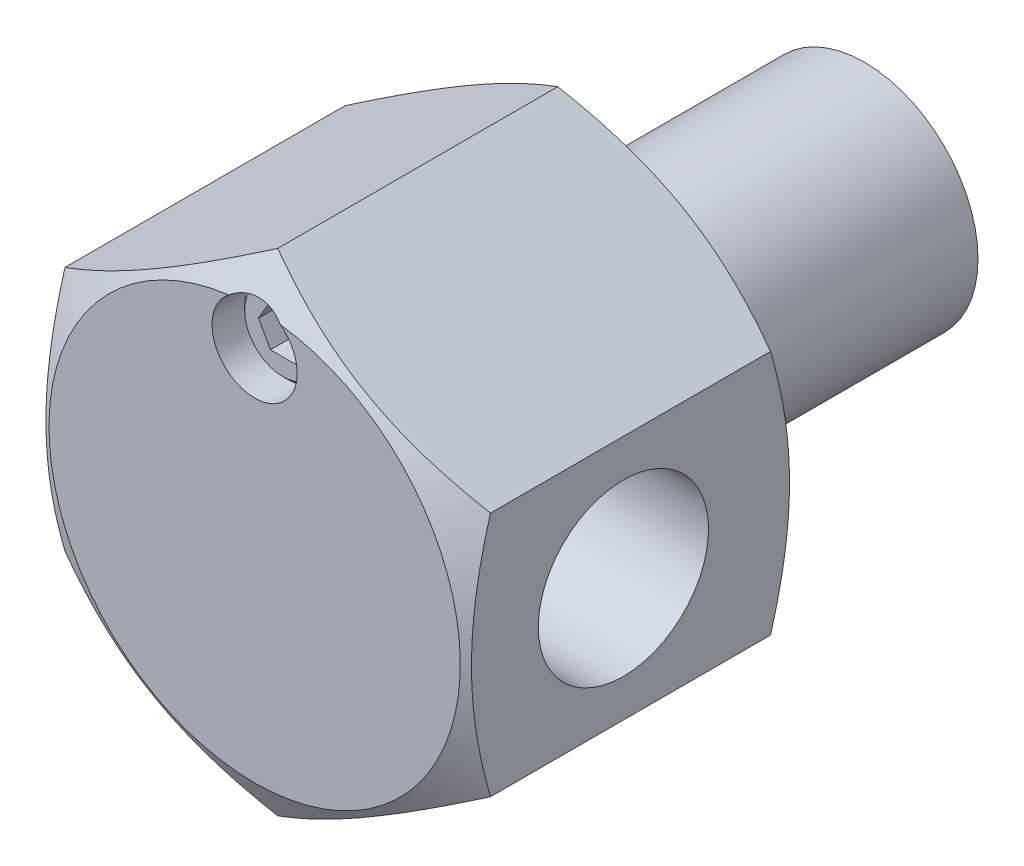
ISO-10303-21;
HEADER;
FILE_DESCRIPTION(('STEP AP214'),'2;1');
FILE_NAME('part.step','',(''),(''),'','','');
FILE_SCHEMA(('AUTOMOTIVE_DESIGN { 1 0 10303 214 1 1 1 1 }'));
ENDSEC;
DATA;
#1=APPLICATION_CONTEXT('core data for automotive mechanical design processes');
#2=APPLICATION_PROTOCOL_DEFINITION('international standard','automotive_design',2000,#1);
#3=PRODUCT_CONTEXT('',#1,'mechanical');
#4=PRODUCT('Part','Part','',(#3));
#5=PRODUCT_RELATED_PRODUCT_CATEGORY('part','',(#4));
#6=PRODUCT_DEFINITION_FORMATION('','',#4);
#7=PRODUCT_DEFINITION_CONTEXT('part definition',#1,'design');
#8=PRODUCT_DEFINITION('design','',#6,#7);
#9=PRODUCT_DEFINITION_SHAPE('','',#8);
#10=(LENGTH_UNIT() NAMED_UNIT(*) SI_UNIT(.MILLI.,.METRE.));
#11=(NAMED_UNIT(*) PLANE_ANGLE_UNIT() SI_UNIT($,.RADIAN.));
#12=(NAMED_UNIT(*) SI_UNIT($,.STERADIAN.) SOLID_ANGLE_UNIT());
#13=UNCERTAINTY_MEASURE_WITH_UNIT(LENGTH_MEASURE(1.E-05),#10,'distance_accuracy_value','');
#14=(GEOMETRIC_REPRESENTATION_CONTEXT(3) GLOBAL_UNCERTAINTY_ASSIGNED_CONTEXT((#13)) GLOBAL_UNIT_ASSIGNED_CONTEXT((#10,
#11,#12)) REPRESENTATION_CONTEXT('',''));
#15=CARTESIAN_POINT('',(0.,0.,0.));
#16=DIRECTION('',(0.,0.,1.));
#17=DIRECTION('',(1.,0.,0.));
#18=AXIS2_PLACEMENT_3D('',#15,#16,#17);
#19=CARTESIAN_POINT('',(-1.73200554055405,12.0125222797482,18.5));
#20=DIRECTION('',(0.,0.,-1.));
#21=DIRECTION('',(0.862387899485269,-0.506248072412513,0.));
#22=AXIS2_PLACEMENT_3D('',#19,#20,#21);
#23=PLANE('',#22);
#24=DIRECTION('',(0.493725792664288,-0.869617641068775,0.));
#25=VECTOR('',#24,1.);
#26=CARTESIAN_POINT('',(-1.73200554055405,12.0125222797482,18.5));
#27=LINE('',#26,#25);
#28=CARTESIAN_POINT('',(-1.73200554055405,12.0125222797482,18.5));
#29=VERTEX_POINT('',#28);
#30=CARTESIAN_POINT('',(-0.876847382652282,10.5063003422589,18.5));
#31=VERTEX_POINT('',#30);
#32=EDGE_CURVE('E390',#29,#31,#27,.T.);
#33=ORIENTED_EDGE('',*,*,#32,.T.);
#34=DIRECTION('',(0.999973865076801,-0.0072297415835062,0.));
#35=VECTOR('',#34,1.);
#36=CARTESIAN_POINT('',(-0.876847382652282,10.5063003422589,18.5));
#37=LINE('',#36,#35);
#38=CARTESIAN_POINT('',(0.855158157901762,10.4937780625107,18.5));
#39=VERTEX_POINT('',#38);
#40=EDGE_CURVE('E387',#31,#39,#37,.T.);
#41=ORIENTED_EDGE('',*,*,#40,.T.);
#42=DIRECTION('',(0.506248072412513,0.862387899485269,0.));
#43=VECTOR('',#42,1.);
#44=CARTESIAN_POINT('',(0.855158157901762,10.4937780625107,18.5));
#45=LINE('',#44,#43);
#46=CARTESIAN_POINT('',(1.73200554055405,11.9874777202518,18.5));
#47=VERTEX_POINT('',#46);
#48=EDGE_CURVE('E384',#39,#47,#45,.T.);
#49=ORIENTED_EDGE('',*,*,#48,.T.);
#50=DIRECTION('',(-0.493725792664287,0.869617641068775,0.));
#51=VECTOR('',#50,1.);
#52=CARTESIAN_POINT('',(1.73200554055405,11.9874777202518,18.5));
#53=LINE('',#52,#51);
#54=CARTESIAN_POINT('',(0.87684738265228,13.4936996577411,18.5));
#55=VERTEX_POINT('',#54);
#56=EDGE_CURVE('E381',#47,#55,#53,.T.);
#57=ORIENTED_EDGE('',*,*,#56,.T.);
#58=DIRECTION('',(-0.999973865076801,0.00722974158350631,0.));
#59=VECTOR('',#58,1.);
#60=CARTESIAN_POINT('',(0.87684738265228,13.4936996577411,18.5));
#61=LINE('',#60,#59);
#62=CARTESIAN_POINT('',(-0.855158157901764,13.5062219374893,18.5));
#63=VERTEX_POINT('',#62);
#64=EDGE_CURVE('E378',#55,#63,#61,.T.);
#65=ORIENTED_EDGE('',*,*,#64,.T.);
#66=DIRECTION('',(-0.506248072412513,-0.862387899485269,0.));
#67=VECTOR('',#66,1.);
#68=CARTESIAN_POINT('',(-0.855158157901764,13.5062219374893,18.5));
#69=LINE('',#68,#67);
#70=EDGE_CURVE('E367',#63,#29,#69,.T.);
#71=ORIENTED_EDGE('',*,*,#70,.T.);
#72=EDGE_LOOP('',(#33,#41,#49,#57,#65,#71));
#73=FACE_BOUND('',#72,.T.);
#74=ADVANCED_FACE('F14',(#73),#23,.F.);
#75=CARTESIAN_POINT('',(0.855158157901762,10.4937780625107,18.5));
#76=DIRECTION('',(0.862387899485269,-0.506248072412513,0.));
#77=DIRECTION('',(0.,0.,1.));
#78=AXIS2_PLACEMENT_3D('',#75,#76,#77);
#79=PLANE('',#78);
#80=DIRECTION('',(0.506248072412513,0.862387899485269,0.));
#81=VECTOR('',#80,1.);
#82=CARTESIAN_POINT('',(0.855158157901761,10.4937780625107,21.));
#83=LINE('',#82,#81);
#84=CARTESIAN_POINT('',(0.855158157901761,10.4937780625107,21.));
#85=VERTEX_POINT('',#84);
#86=CARTESIAN_POINT('',(1.73200554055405,11.9874777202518,21.));
#87=VERTEX_POINT('',#86);
#88=EDGE_CURVE('E401',#85,#87,#83,.T.);
#89=ORIENTED_EDGE('',*,*,#88,.T.);
#90=DIRECTION('',(0.,0.,1.));
#91=VECTOR('',#90,1.);
#92=CARTESIAN_POINT('',(1.73200554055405,11.9874777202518,18.5));
#93=LINE('',#92,#91);
#94=EDGE_CURVE('E369',#47,#87,#93,.T.);
#95=ORIENTED_EDGE('',*,*,#94,.F.);
#96=ORIENTED_EDGE('',*,*,#48,.F.);
#97=DIRECTION('',(0.,0.,1.));
#98=VECTOR('',#97,1.);
#99=CARTESIAN_POINT('',(0.855158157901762,10.4937780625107,18.5));
#100=LINE('',#99,#98);
#101=EDGE_CURVE('E366',#39,#85,#100,.T.);
#102=ORIENTED_EDGE('',*,*,#101,.T.);
#103=EDGE_LOOP('',(#89,#95,#96,#102));
#104=FACE_BOUND('',#103,.T.);
#105=ADVANCED_FACE('F416',(#104),#79,.F.);
#106=CARTESIAN_POINT('',(1.73200554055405,11.9874777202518,18.5));
#107=DIRECTION('',(0.869617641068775,0.493725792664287,0.));
#108=DIRECTION('',(0.493725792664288,-0.869617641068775,0.));
#109=AXIS2_PLACEMENT_3D('',#106,#107,#108);
#110=PLANE('',#109);
#111=DIRECTION('',(-0.493725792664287,0.869617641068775,0.));
#112=VECTOR('',#111,1.);
#113=CARTESIAN_POINT('',(1.73200554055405,11.9874777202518,21.));
#114=LINE('',#113,#112);
#115=CARTESIAN_POINT('',(0.87684738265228,13.4936996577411,21.));
#116=VERTEX_POINT('',#115);
#117=EDGE_CURVE('E398',#87,#116,#114,.T.);
#118=ORIENTED_EDGE('',*,*,#117,.T.);
#119=DIRECTION('',(0.,0.,1.));
#120=VECTOR('',#119,1.);
#121=CARTESIAN_POINT('',(0.87684738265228,13.4936996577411,18.5));
#122=LINE('',#121,#120);
#123=EDGE_CURVE('E371',#55,#116,#122,.T.);
#124=ORIENTED_EDGE('',*,*,#123,.F.);
#125=ORIENTED_EDGE('',*,*,#56,.F.);
#126=ORIENTED_EDGE('',*,*,#94,.T.);
#127=EDGE_LOOP('',(#118,#124,#125,#126));
#128=FACE_BOUND('',#127,.T.);
#129=ADVANCED_FACE('F426',(#128),#110,.F.);
#130=CARTESIAN_POINT('',(0.87684738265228,13.4936996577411,18.5));
#131=DIRECTION('',(0.00722974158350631,0.999973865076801,0.));
#132=DIRECTION('',(0.999973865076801,-0.00722974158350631,0.));
#133=AXIS2_PLACEMENT_3D('',#130,#131,#132);
#134=PLANE('',#133);
#135=DIRECTION('',(-0.999973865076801,0.00722974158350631,0.));
#136=VECTOR('',#135,1.);
#137=CARTESIAN_POINT('',(0.87684738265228,13.4936996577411,21.));
#138=LINE('',#137,#136);
#139=CARTESIAN_POINT('',(-0.855158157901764,13.5062219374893,21.));
#140=VERTEX_POINT('',#139);
#141=EDGE_CURVE('E395',#116,#140,#138,.T.);
#142=ORIENTED_EDGE('',*,*,#141,.T.);
#143=DIRECTION('',(0.,0.,1.));
#144=VECTOR('',#143,1.);
#145=CARTESIAN_POINT('',(-0.855158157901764,13.5062219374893,18.5));
#146=LINE('',#145,#144);
#147=EDGE_CURVE('E373',#63,#140,#146,.T.);
#148=ORIENTED_EDGE('',*,*,#147,.F.);
#149=ORIENTED_EDGE('',*,*,#64,.F.);
#150=ORIENTED_EDGE('',*,*,#123,.T.);
#151=EDGE_LOOP('',(#142,#148,#149,#150));
#152=FACE_BOUND('',#151,.T.);
#153=ADVANCED_FACE('F423',(#152),#134,.F.);
#154=CARTESIAN_POINT('',(-0.855158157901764,13.5062219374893,18.5));
#155=DIRECTION('',(-0.862387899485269,0.506248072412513,0.));
#156=DIRECTION('',(0.,0.,-1.));
#157=AXIS2_PLACEMENT_3D('',#154,#155,#156);
#158=PLANE('',#157);
#159=DIRECTION('',(-0.506248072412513,-0.862387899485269,0.));
#160=VECTOR('',#159,1.);
#161=CARTESIAN_POINT('',(-0.855158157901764,13.5062219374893,21.));
#162=LINE('',#161,#160);
#163=CARTESIAN_POINT('',(-1.73200554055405,12.0125222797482,21.));
#164=VERTEX_POINT('',#163);
#165=EDGE_CURVE('E393',#140,#164,#162,.T.);
#166=ORIENTED_EDGE('',*,*,#165,.T.);
#167=DIRECTION('',(0.,0.,1.));
#168=VECTOR('',#167,1.);
#169=CARTESIAN_POINT('',(-1.73200554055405,12.0125222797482,18.5));
#170=LINE('',#169,#168);
#171=EDGE_CURVE('E36',#29,#164,#170,.T.);
#172=ORIENTED_EDGE('',*,*,#171,.F.);
#173=ORIENTED_EDGE('',*,*,#70,.F.);
#174=ORIENTED_EDGE('',*,*,#147,.T.);
#175=EDGE_LOOP('',(#166,#172,#173,#174));
#176=FACE_BOUND('',#175,.T.);
#177=ADVANCED_FACE('F421',(#176),#158,.F.);
#178=CARTESIAN_POINT('',(-1.73200554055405,12.0125222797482,18.5));
#179=DIRECTION('',(-0.869617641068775,-0.493725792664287,0.));
#180=DIRECTION('',(-0.493725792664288,0.869617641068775,0.));
#181=AXIS2_PLACEMENT_3D('',#178,#179,#180);
#182=PLANE('',#181);
#183=DIRECTION('',(0.493725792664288,-0.869617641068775,0.));
#184=VECTOR('',#183,1.);
#185=CARTESIAN_POINT('',(-1.73200554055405,12.0125222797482,21.));
#186=LINE('',#185,#184);
#187=CARTESIAN_POINT('',(-0.876847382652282,10.5063003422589,21.));
#188=VERTEX_POINT('',#187);
#189=EDGE_CURVE('E29',#164,#188,#186,.T.);
#190=ORIENTED_EDGE('',*,*,#189,.T.);
#191=DIRECTION('',(0.,0.,1.));
#192=VECTOR('',#191,1.);
#193=CARTESIAN_POINT('',(-0.876847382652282,10.5063003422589,18.5));
#194=LINE('',#193,#192);
#195=EDGE_CURVE('E364',#31,#188,#194,.T.);
#196=ORIENTED_EDGE('',*,*,#195,.F.);
#197=ORIENTED_EDGE('',*,*,#32,.F.);
#198=ORIENTED_EDGE('',*,*,#171,.T.);
#199=EDGE_LOOP('',(#190,#196,#197,#198));
#200=FACE_BOUND('',#199,.T.);
#201=ADVANCED_FACE('F419',(#200),#182,.F.);
#202=CARTESIAN_POINT('',(-0.876847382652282,10.5063003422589,18.5));
#203=DIRECTION('',(-0.0072297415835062,-0.999973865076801,0.));
#204=DIRECTION('',(-0.999973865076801,0.0072297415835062,0.));
#205=AXIS2_PLACEMENT_3D('',#202,#203,#204);
#206=PLANE('',#205);
#207=DIRECTION('',(0.999973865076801,-0.0072297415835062,0.));
#208=VECTOR('',#207,1.);
#209=CARTESIAN_POINT('',(-0.876847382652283,10.5063003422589,21.));
#210=LINE('',#209,#208);
#211=EDGE_CURVE('E404',#188,#85,#210,.T.);
#212=ORIENTED_EDGE('',*,*,#211,.T.);
#213=ORIENTED_EDGE('',*,*,#101,.F.);
#214=ORIENTED_EDGE('',*,*,#40,.F.);
#215=ORIENTED_EDGE('',*,*,#195,.T.);
#216=EDGE_LOOP('',(#212,#213,#214,#215));
#217=FACE_BOUND('',#216,.T.);
#218=ADVANCED_FACE('F409',(#217),#206,.F.);
#219=CARTESIAN_POINT('',(0.,12.,21.));
#220=DIRECTION('',(0.,0.,-1.));
#221=DIRECTION('',(0.862387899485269,-0.506248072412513,0.));
#222=AXIS2_PLACEMENT_3D('',#219,#220,#221);
#223=PLANE('',#222);
#224=CARTESIAN_POINT('',(0.,12.,21.));
#225=DIRECTION('',(0.,0.,-1.));
#226=DIRECTION('',(0.862387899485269,-0.506248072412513,0.));
#227=AXIS2_PLACEMENT_3D('',#224,#225,#226);
#228=CIRCLE('',#227,2.7);
#229=CARTESIAN_POINT('',(2.32844732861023,10.6331302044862,21.));
#230=VERTEX_POINT('',#229);
#231=EDGE_CURVE('E9',#230,#230,#228,.F.);
#232=ORIENTED_EDGE('',*,*,#231,.T.);
#233=EDGE_LOOP('',(#232));
#234=FACE_BOUND('',#233,.T.);
#235=ORIENTED_EDGE('',*,*,#211,.F.);
#236=ORIENTED_EDGE('',*,*,#189,.F.);
#237=ORIENTED_EDGE('',*,*,#165,.F.);
#238=ORIENTED_EDGE('',*,*,#141,.F.);
#239=ORIENTED_EDGE('',*,*,#117,.F.);
#240=ORIENTED_EDGE('',*,*,#88,.F.);
#241=EDGE_LOOP('',(#235,#236,#237,#238,#239,#240));
#242=FACE_BOUND('',#241,.T.);
#243=ADVANCED_FACE('F16',(#234,#242),#223,.F.);
#244=CARTESIAN_POINT('',(0.,12.,20.7));
#245=DIRECTION('',(0.,0.,-1.));
#246=DIRECTION('',(0.862387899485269,-0.506248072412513,0.));
#247=AXIS2_PLACEMENT_3D('',#244,#245,#246);
#248=CONICAL_SURFACE('',#247,3.,0.785398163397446);
#249=ORIENTED_EDGE('',*,*,#231,.F.);
#250=EDGE_LOOP('',(#249));
#251=FACE_BOUND('',#250,.T.);
#252=CARTESIAN_POINT('',(0.,12.,20.7));
#253=DIRECTION('',(0.,0.,-1.));
#254=DIRECTION('',(0.862387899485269,-0.506248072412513,0.));
#255=AXIS2_PLACEMENT_3D('',#252,#253,#254);
#256=CIRCLE('',#255,3.);
#257=CARTESIAN_POINT('',(2.58716369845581,10.4812557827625,20.7));
#258=VERTEX_POINT('',#257);
#259=EDGE_CURVE('E22',#258,#258,#256,.T.);
#260=ORIENTED_EDGE('',*,*,#259,.F.);
#261=EDGE_LOOP('',(#260));
#262=FACE_BOUND('',#261,.T.);
#263=ADVANCED_FACE('F451',(#251,#262),#248,.T.);
#264=CARTESIAN_POINT('',(0.,12.,1.));
#265=DIRECTION('',(0.,0.,-1.));
#266=DIRECTION('',(0.862387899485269,-0.506248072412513,0.));
#267=AXIS2_PLACEMENT_3D('',#264,#265,#266);
#268=PLANE('',#267);
#269=CARTESIAN_POINT('',(0.,12.,1.));
#270=DIRECTION('',(0.,0.,-1.));
#271=DIRECTION('',(0.862387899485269,-0.506248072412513,0.));
#272=AXIS2_PLACEMENT_3D('',#269,#270,#271);
#273=CIRCLE('',#272,3.);
#274=CARTESIAN_POINT('',(2.58716369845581,10.4812557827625,1.));
#275=VERTEX_POINT('',#274);
#276=EDGE_CURVE('E350',#275,#275,#273,.T.);
#277=ORIENTED_EDGE('',*,*,#276,.T.);
#278=EDGE_LOOP('',(#277));
#279=FACE_BOUND('',#278,.T.);
#280=CARTESIAN_POINT('',(0.,12.,1.));
#281=DIRECTION('',(0.,0.,-1.));
#282=DIRECTION('',(0.862387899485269,-0.506248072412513,0.));
#283=AXIS2_PLACEMENT_3D('',#280,#281,#282);
#284=CIRCLE('',#283,2.);
#285=CARTESIAN_POINT('',(1.72477579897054,10.987503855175,1.));
#286=VERTEX_POINT('',#285);
#287=EDGE_CURVE('E359',#286,#286,#284,.T.);
#288=ORIENTED_EDGE('',*,*,#287,.F.);
#289=EDGE_LOOP('',(#288));
#290=FACE_BOUND('',#289,.T.);
#291=ADVANCED_FACE('F448',(#279,#290),#268,.T.);
#292=CARTESIAN_POINT('',(0.,12.,0.));
#293=DIRECTION('',(0.,0.,1.));
#294=DIRECTION('',(-0.862387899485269,0.506248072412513,0.));
#295=AXIS2_PLACEMENT_3D('',#292,#293,#294);
#296=CYLINDRICAL_SURFACE('',#295,2.);
#297=CARTESIAN_POINT('',(0.,12.,0.));
#298=DIRECTION('',(0.,0.,-1.));
#299=DIRECTION('',(0.862387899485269,-0.506248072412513,0.));
#300=AXIS2_PLACEMENT_3D('',#297,#298,#299);
#301=CIRCLE('',#300,2.);
#302=CARTESIAN_POINT('',(1.72477579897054,10.987503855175,0.));
#303=VERTEX_POINT('',#302);
#304=EDGE_CURVE('E355',#303,#303,#301,.T.);
#305=ORIENTED_EDGE('',*,*,#304,.F.);
#306=EDGE_LOOP('',(#305));
#307=FACE_BOUND('',#306,.T.);
#308=ORIENTED_EDGE('',*,*,#287,.T.);
#309=EDGE_LOOP('',(#308));
#310=FACE_BOUND('',#309,.T.);
#311=ADVANCED_FACE('F445',(#307,#310),#296,.T.);
#312=CARTESIAN_POINT('',(0.,12.,0.));
#313=DIRECTION('',(0.,0.,-1.));
#314=DIRECTION('',(0.862387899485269,-0.506248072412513,0.));
#315=AXIS2_PLACEMENT_3D('',#312,#313,#314);
#316=PLANE('',#315);
#317=ORIENTED_EDGE('',*,*,#304,.T.);
#318=EDGE_LOOP('',(#317));
#319=FACE_BOUND('',#318,.T.);
#320=ADVANCED_FACE('F442',(#319),#316,.T.);
#321=CARTESIAN_POINT('',(0.,0.,-20.));
#322=DIRECTION('',(0.,0.,-1.));
#323=DIRECTION('',(-1.,0.,0.));
#324=AXIS2_PLACEMENT_3D('',#321,#322,#323);
#325=PLANE('',#324);
#326=CARTESIAN_POINT('',(0.,0.,-20.));
#327=DIRECTION('',(0.,0.,-1.));
#328=DIRECTION('',(-1.,0.,0.));
#329=AXIS2_PLACEMENT_3D('',#326,#327,#328);
#330=CIRCLE('',#329,8.);
#331=CARTESIAN_POINT('',(-8.,0.,-20.));
#332=VERTEX_POINT('',#331);
#333=EDGE_CURVE('E281',#332,#332,#330,.T.);
#334=ORIENTED_EDGE('',*,*,#333,.T.);
#335=EDGE_LOOP('',(#334));
#336=FACE_BOUND('',#335,.T.);
#337=ADVANCED_FACE('F337',(#336),#325,.T.);
#338=CARTESIAN_POINT('',(-15.,0.,12.));
#339=DIRECTION('',(-1.,0.,0.));
#340=DIRECTION('',(0.,-1.,0.));
#341=AXIS2_PLACEMENT_3D('',#338,#339,#340);
#342=CYLINDRICAL_SURFACE('',#341,6.);
#343=CARTESIAN_POINT('',(15.,0.,12.));
#344=DIRECTION('',(-1.,0.,0.));
#345=DIRECTION('',(0.,-1.,0.));
#346=AXIS2_PLACEMENT_3D('',#343,#344,#345);
#347=CIRCLE('',#346,6.);
#348=CARTESIAN_POINT('',(15.,-6.,12.));
#349=VERTEX_POINT('',#348);
#350=EDGE_CURVE('E268',#349,#349,#347,.T.);
#351=ORIENTED_EDGE('',*,*,#350,.F.);
#352=EDGE_LOOP('',(#351));
#353=FACE_BOUND('',#352,.T.);
#354=CARTESIAN_POINT('',(-15.,0.,12.));
#355=DIRECTION('',(-1.,0.,0.));
#356=DIRECTION('',(0.,-1.,0.));
#357=AXIS2_PLACEMENT_3D('',#354,#355,#356);
#358=CIRCLE('',#357,6.);
#359=CARTESIAN_POINT('',(-15.,-6.,12.));
#360=VERTEX_POINT('',#359);
#361=EDGE_CURVE('E270',#360,#360,#358,.T.);
#362=ORIENTED_EDGE('',*,*,#361,.T.);
#363=EDGE_LOOP('',(#362));
#364=FACE_BOUND('',#363,.T.);
#365=ADVANCED_FACE('F174',(#353,#364),#342,.F.);
#366=CARTESIAN_POINT('',(0.,0.,-20.));
#367=DIRECTION('',(0.,0.,1.));
#368=DIRECTION('',(1.,0.,0.));
#369=AXIS2_PLACEMENT_3D('',#366,#367,#368);
#370=CYLINDRICAL_SURFACE('',#369,8.);
#371=ORIENTED_EDGE('',*,*,#333,.F.);
#372=EDGE_LOOP('',(#371));
#373=FACE_BOUND('',#372,.T.);
#374=CARTESIAN_POINT('',(0.,0.,0.));
#375=DIRECTION('',(0.,0.,1.));
#376=DIRECTION('',(1.,0.,0.));
#377=AXIS2_PLACEMENT_3D('',#374,#375,#376);
#378=CIRCLE('',#377,8.);
#379=CARTESIAN_POINT('',(8.,0.,0.));
#380=VERTEX_POINT('',#379);
#381=EDGE_CURVE('E141',#380,#380,#378,.F.);
#382=ORIENTED_EDGE('',*,*,#381,.T.);
#383=EDGE_LOOP('',(#382));
#384=FACE_BOUND('',#383,.T.);
#385=ADVANCED_FACE('F329',(#373,#384),#370,.T.);
#386=CARTESIAN_POINT('',(15.,8.6602540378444,23.));
#387=DIRECTION('',(-0.5,-0.866025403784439,0.));
#388=DIRECTION('',(0.866025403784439,-0.5,0.));
#389=AXIS2_PLACEMENT_3D('',#386,#387,#388);
#390=PLANE('',#389);
#391=DIRECTION('',(0.,0.,-1.));
#392=VECTOR('',#391,1.);
#393=CARTESIAN_POINT('',(0.,17.3205080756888,23.));
#394=LINE('',#393,#392);
#395=CARTESIAN_POINT('',(0.,17.3205080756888,21.3715789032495));
#396=VERTEX_POINT('',#395);
#397=CARTESIAN_POINT('',(0.,17.3205080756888,1.62842109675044));
#398=VERTEX_POINT('',#397);
#399=EDGE_CURVE('E139',#396,#398,#394,.T.);
#400=ORIENTED_EDGE('',*,*,#399,.F.);
#401=CARTESIAN_POINT('',(-0.00020000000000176,17.3206235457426,21.3715122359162));
#402=CARTESIAN_POINT('',(0.329494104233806,17.130274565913,21.4814030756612));
#403=CARTESIAN_POINT('',(0.660474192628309,16.939183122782,21.5863072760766));
#404=CARTESIAN_POINT('',(1.32508844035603,16.5554679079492,21.7847562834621));
#405=CARTESIAN_POINT('',(1.65872343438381,16.3628436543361,21.8782973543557));
#406=CARTESIAN_POINT('',(2.32929228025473,15.9756905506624,22.0527627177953));
#407=CARTESIAN_POINT('',(2.66623200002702,15.7811583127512,22.133657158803));
#408=CARTESIAN_POINT('',(3.34245276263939,15.3907420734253,22.2810922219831));
#409=CARTESIAN_POINT('',(3.68173367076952,15.1948581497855,22.3476336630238));
#410=CARTESIAN_POINT('',(4.35394314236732,14.8067578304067,22.4635324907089));
#411=CARTESIAN_POINT('',(4.68682180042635,14.6145702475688,22.5132734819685));
#412=CARTESIAN_POINT('',(5.3541044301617,14.2293144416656,22.5966781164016));
#413=CARTESIAN_POINT('',(5.6885084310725,14.0362462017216,22.6303414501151));
#414=CARTESIAN_POINT('',(6.35787818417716,13.6497853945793,22.6807407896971));
#415=CARTESIAN_POINT('',(6.69284279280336,13.4563934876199,22.6974969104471));
#416=CARTESIAN_POINT('',(7.36308121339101,13.0694311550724,22.7137214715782));
#417=CARTESIAN_POINT('',(7.69835501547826,12.8758607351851,22.7131904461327));
#418=CARTESIAN_POINT('',(8.32514688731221,12.5139822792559,22.696048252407));
#419=CARTESIAN_POINT('',(8.61670962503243,12.3456484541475,22.6815280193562));
#420=CARTESIAN_POINT('',(9.19916443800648,12.0093680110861,22.6396877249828));
#421=CARTESIAN_POINT('',(9.49005646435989,11.8414214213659,22.6123667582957));
#422=CARTESIAN_POINT('',(10.0710118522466,11.5060066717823,22.5454013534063));
#423=CARTESIAN_POINT('',(10.3610743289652,11.338539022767,22.5057467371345));
#424=CARTESIAN_POINT('',(10.939839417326,11.0043888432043,22.4148097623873));
#425=CARTESIAN_POINT('',(11.2285419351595,10.8377063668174,22.3635266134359));
#426=CARTESIAN_POINT('',(12.1049144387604,10.3317324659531,22.1909380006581));
#427=CARTESIAN_POINT('',(12.6900465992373,9.99390625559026,22.0524236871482));
#428=CARTESIAN_POINT('',(13.8515859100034,9.32329122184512,21.73805289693));
#429=CARTESIAN_POINT('',(14.4280079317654,8.99049381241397,21.5622702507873));
#430=CARTESIAN_POINT('',(15.0002,8.66013856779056,21.3715122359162));
#431=B_SPLINE_CURVE_WITH_KNOTS('',3,(#401,#402,#403,#404,#405,#406,#407,#408,#409,#410,#411,
#412,#413,#414,#415,#416,#417,#418,#419,#420,#421,#422,#423,#424,#425,#426,#427,#428,#429,#430),
.UNSPECIFIED.,.F.,.F.,(4,2,2,2,2,2,2,2,2,2,2,2,2,2,4),(0.,1.18875411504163,2.37789802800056,
3.56980778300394,4.76164951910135,5.92407379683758,7.08652044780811,8.24758247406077,
9.40860862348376,10.4193068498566,11.4300765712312,12.4416826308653,13.4533574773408,
15.5211962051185,17.584976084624),.UNSPECIFIED.);
#432=CARTESIAN_POINT('',(15.,8.6602540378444,21.3715789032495));
#433=VERTEX_POINT('',#432);
#434=EDGE_CURVE('E121',#396,#433,#431,.T.);
#435=ORIENTED_EDGE('',*,*,#434,.T.);
#436=DIRECTION('',(0.,0.,-1.));
#437=VECTOR('',#436,1.);
#438=CARTESIAN_POINT('',(15.,8.6602540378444,23.));
#439=LINE('',#438,#437);
#440=CARTESIAN_POINT('',(15.,8.6602540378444,1.62842109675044));
#441=VERTEX_POINT('',#440);
#442=EDGE_CURVE('E284',#433,#441,#439,.T.);
#443=ORIENTED_EDGE('',*,*,#442,.T.);
#444=CARTESIAN_POINT('',(15.0002,8.66013856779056,1.62848776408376));
#445=CARTESIAN_POINT('',(14.6705058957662,8.85048754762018,1.51859692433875));
#446=CARTESIAN_POINT('',(14.3395258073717,9.04157899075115,1.41369272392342));
#447=CARTESIAN_POINT('',(13.674911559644,9.42529420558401,1.21524371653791));
#448=CARTESIAN_POINT('',(13.3412765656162,9.61791845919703,1.1217026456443));
#449=CARTESIAN_POINT('',(12.6707077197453,10.0050715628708,0.947237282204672));
#450=CARTESIAN_POINT('',(12.333767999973,10.199603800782,0.866342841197));
#451=CARTESIAN_POINT('',(11.6575472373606,10.5900200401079,0.718907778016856));
#452=CARTESIAN_POINT('',(11.3182663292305,10.7859039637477,0.652366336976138));
#453=CARTESIAN_POINT('',(10.6460568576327,11.1740042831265,0.536467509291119));
#454=CARTESIAN_POINT('',(10.3131781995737,11.3661918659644,0.486726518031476));
#455=CARTESIAN_POINT('',(9.6458955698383,11.7514476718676,0.403321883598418));
#456=CARTESIAN_POINT('',(9.3114915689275,11.9445159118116,0.369658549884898));
#457=CARTESIAN_POINT('',(8.64212181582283,12.3309767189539,0.319259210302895));
#458=CARTESIAN_POINT('',(8.30715720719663,12.5243686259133,0.302503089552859));
#459=CARTESIAN_POINT('',(7.63691878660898,12.9113309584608,0.28627852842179));
#460=CARTESIAN_POINT('',(7.30164498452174,13.1049013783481,0.286809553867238));
#461=CARTESIAN_POINT('',(6.67485311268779,13.4667798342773,0.303951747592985));
#462=CARTESIAN_POINT('',(6.38329037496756,13.6351136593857,0.318471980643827));
#463=CARTESIAN_POINT('',(5.80083556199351,13.9713941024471,0.360312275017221));
#464=CARTESIAN_POINT('',(5.5099435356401,14.1393406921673,0.387633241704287));
#465=CARTESIAN_POINT('',(4.92898814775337,14.4747554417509,0.454598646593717));
#466=CARTESIAN_POINT('',(4.63892567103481,14.6422230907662,0.494253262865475));
#467=CARTESIAN_POINT('',(4.06016058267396,14.9763732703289,0.585190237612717));
#468=CARTESIAN_POINT('',(3.77145806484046,15.1430557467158,0.636473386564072));
#469=CARTESIAN_POINT('',(2.89508556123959,15.6490296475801,0.809061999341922));
#470=CARTESIAN_POINT('',(2.30995340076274,15.9868558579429,0.947576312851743));
#471=CARTESIAN_POINT('',(1.14841408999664,16.6574708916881,1.26194710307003));
#472=CARTESIAN_POINT('',(0.571992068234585,16.9902683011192,1.43772974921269));
#473=CARTESIAN_POINT('',(-0.00020000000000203,17.3206235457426,1.62848776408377));
#474=B_SPLINE_CURVE_WITH_KNOTS('',3,(#444,#445,#446,#447,#448,#449,#450,#451,#452,#453,#454,
#455,#456,#457,#458,#459,#460,#461,#462,#463,#464,#465,#466,#467,#468,#469,#470,#471,#472,#473),
.UNSPECIFIED.,.F.,.F.,(4,2,2,2,2,2,2,2,2,2,2,2,2,2,4),(0.,1.18875411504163,2.37789802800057,
3.56980778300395,4.76164951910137,5.9240737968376,7.08652044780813,8.2475824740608,
9.40860862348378,10.4193068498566,11.4300765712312,12.4416826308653,13.4533574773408,
15.5211962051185,17.5849760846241),.UNSPECIFIED.);
#475=EDGE_CURVE('E218',#441,#398,#474,.T.);
#476=ORIENTED_EDGE('',*,*,#475,.T.);
#477=EDGE_LOOP('',(#400,#435,#443,#476));
#478=FACE_BOUND('',#477,.T.);
#479=ADVANCED_FACE('F228',(#478),#390,.F.);
#480=CARTESIAN_POINT('',(15.,-8.66025403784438,23.));
#481=DIRECTION('',(-1.,0.,0.));
#482=DIRECTION('',(0.,-1.,0.));
#483=AXIS2_PLACEMENT_3D('',#480,#481,#482);
#484=PLANE('',#483);
#485=ORIENTED_EDGE('',*,*,#350,.T.);
#486=EDGE_LOOP('',(#485));
#487=FACE_BOUND('',#486,.T.);
#488=ORIENTED_EDGE('',*,*,#442,.F.);
#489=CARTESIAN_POINT('',(15.,-22.9282544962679,15.5527625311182));
#490=CARTESIAN_POINT('',(15.,-22.5991296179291,15.7117735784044));
#491=CARTESIAN_POINT('',(15.,-22.269605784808,15.8699584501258));
#492=CARTESIAN_POINT('',(15.,-21.6096759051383,16.1844861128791));
#493=CARTESIAN_POINT('',(15.,-21.2792698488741,16.3408288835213));
#494=CARTESIAN_POINT('',(15.,-20.2865045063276,16.8068550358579));
#495=CARTESIAN_POINT('',(15.,-19.6227057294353,17.1134840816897));
#496=CARTESIAN_POINT('',(15.,-18.2866885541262,17.7183727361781));
#497=CARTESIAN_POINT('',(15.,-17.6144436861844,18.0165740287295));
#498=CARTESIAN_POINT('',(15.,-16.2644145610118,18.6001154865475));
#499=CARTESIAN_POINT('',(15.,-15.5866305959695,18.8854563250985));
#500=CARTESIAN_POINT('',(15.,-14.2162180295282,19.4431583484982));
#501=CARTESIAN_POINT('',(15.,-13.5235088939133,19.715322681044));
#502=CARTESIAN_POINT('',(15.,-12.1299010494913,20.2382363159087));
#503=CARTESIAN_POINT('',(15.,-11.4290014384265,20.4889832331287));
#504=CARTESIAN_POINT('',(15.,-10.0193737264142,20.9622919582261));
#505=CARTESIAN_POINT('',(15.,-9.31066603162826,21.1849140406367));
#506=CARTESIAN_POINT('',(15.,-7.88310870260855,21.5947279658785));
#507=CARTESIAN_POINT('',(15.,-7.16426236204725,21.7819310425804));
#508=CARTESIAN_POINT('',(15.,-6.07824937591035,22.0293009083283));
#509=CARTESIAN_POINT('',(15.,-5.71486851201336,22.1061991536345));
#510=CARTESIAN_POINT('',(15.,-4.98569640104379,22.2476312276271));
#511=CARTESIAN_POINT('',(15.,-4.61990520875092,22.3121653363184));
#512=CARTESIAN_POINT('',(15.,-3.88616088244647,22.4277227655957));
#513=CARTESIAN_POINT('',(15.,-3.51820761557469,22.4787452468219));
#514=CARTESIAN_POINT('',(15.,-2.78056397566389,22.5662532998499));
#515=CARTESIAN_POINT('',(15.,-2.41087360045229,22.6027388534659));
#516=CARTESIAN_POINT('',(15.,-1.67261840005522,22.6601929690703));
#517=CARTESIAN_POINT('',(15.,-1.30406110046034,22.6812575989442));
#518=CARTESIAN_POINT('',(15.,-0.566387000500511,22.7077597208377));
#519=CARTESIAN_POINT('',(15.,-0.197270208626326,22.7131974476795));
#520=CARTESIAN_POINT('',(15.,0.540759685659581,22.7083170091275));
#521=CARTESIAN_POINT('',(15.,0.909672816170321,22.6980031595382));
#522=CARTESIAN_POINT('',(15.,1.64674081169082,22.6618748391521));
#523=CARTESIAN_POINT('',(15.,2.01489564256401,22.6360596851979));
#524=CARTESIAN_POINT('',(15.,2.90820872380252,22.5551498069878));
#525=CARTESIAN_POINT('',(15.,3.43267212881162,22.4922321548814));
#526=CARTESIAN_POINT('',(15.,4.47746339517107,22.3384510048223));
#527=CARTESIAN_POINT('',(15.,4.99779062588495,22.2475833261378));
#528=CARTESIAN_POINT('',(15.,6.5534890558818,21.9376161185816));
#529=CARTESIAN_POINT('',(15.,7.58154116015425,21.6813602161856));
#530=CARTESIAN_POINT('',(15.,9.11925712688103,21.2398315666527));
#531=CARTESIAN_POINT('',(15.,9.63696359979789,21.0809841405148));
#532=CARTESIAN_POINT('',(15.,10.6673748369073,20.747536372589));
#533=CARTESIAN_POINT('',(15.,11.1800791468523,20.5729346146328));
#534=CARTESIAN_POINT('',(15.,12.1979290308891,20.2116921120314));
#535=CARTESIAN_POINT('',(15.,12.7031009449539,20.0251249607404));
#536=CARTESIAN_POINT('',(15.,13.4576819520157,19.7372382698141));
#537=CARTESIAN_POINT('',(15.,13.7086390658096,19.6399531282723));
#538=CARTESIAN_POINT('',(15.,14.2095800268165,19.4429218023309));
#539=CARTESIAN_POINT('',(15.,14.4595638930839,19.3431756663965));
#540=CARTESIAN_POINT('',(15.,14.7090950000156,19.2423102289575));
#541=B_SPLINE_CURVE_WITH_KNOTS('',3,(#489,#490,#491,#492,#493,#494,#495,#496,#497,#498,#499,
#500,#501,#502,#503,#504,#505,#506,#507,#508,#509,#510,#511,#512,#513,#514,#515,#516,#517,#518,
#519,#520,#521,#522,#523,#524,#525,#526,#527,#528,#529,#530,#531,#532,#533,#534,#535,#536,#537,
#538,#539,#540),.UNSPECIFIED.,.F.,.F.,(4,2,2,2,2,2,2,2,2,2,2,2,2,2,2,2,2,2,2,2,2,2,2,2,2,4),(0.,
1.09656945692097,2.19315104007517,4.38667315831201,6.59281796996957,8.79884714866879,
11.0313494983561,13.2641001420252,15.4919815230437,17.7191550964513,18.8332635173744,
19.9473467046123,21.0614990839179,22.1756528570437,23.2828052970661,24.3899411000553,
25.4967736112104,26.6036549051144,28.1874260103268,29.7714341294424,32.9455623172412,
34.5700198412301,36.1946235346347,37.8100482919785,38.6174990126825,39.4249338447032),.UNSPECIFIED.);
#542=CARTESIAN_POINT('',(15.,-8.66025403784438,21.3715789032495));
#543=VERTEX_POINT('',#542);
#544=EDGE_CURVE('E291',#433,#543,#541,.F.);
#545=ORIENTED_EDGE('',*,*,#544,.T.);
#546=DIRECTION('',(0.,0.,-1.));
#547=VECTOR('',#546,1.);
#548=CARTESIAN_POINT('',(15.,-8.66025403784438,23.));
#549=LINE('',#548,#547);
#550=CARTESIAN_POINT('',(15.,-8.6602540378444,1.62842109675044));
#551=VERTEX_POINT('',#550);
#552=EDGE_CURVE('E286',#543,#551,#549,.T.);
#553=ORIENTED_EDGE('',*,*,#552,.T.);
#554=CARTESIAN_POINT('',(15.,-22.9282544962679,7.44723746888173));
#555=CARTESIAN_POINT('',(15.,-22.599129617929,7.28822642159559));
#556=CARTESIAN_POINT('',(15.,-22.269605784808,7.13004154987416));
#557=CARTESIAN_POINT('',(15.,-21.6096759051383,6.81551388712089));
#558=CARTESIAN_POINT('',(15.,-21.2792698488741,6.65917111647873));
#559=CARTESIAN_POINT('',(15.,-20.2865045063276,6.19314496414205));
#560=CARTESIAN_POINT('',(15.,-19.6227057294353,5.88651591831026));
#561=CARTESIAN_POINT('',(15.,-18.2866885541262,5.28162726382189));
#562=CARTESIAN_POINT('',(15.,-17.6144436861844,4.98342597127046));
#563=CARTESIAN_POINT('',(15.,-16.2644145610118,4.39988451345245));
#564=CARTESIAN_POINT('',(15.,-15.5866305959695,4.11454367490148));
#565=CARTESIAN_POINT('',(15.,-14.2162180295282,3.55684165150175));
#566=CARTESIAN_POINT('',(15.,-13.5235088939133,3.28467731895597));
#567=CARTESIAN_POINT('',(15.,-12.1299010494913,2.76176368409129));
#568=CARTESIAN_POINT('',(15.,-11.4290014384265,2.51101676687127));
#569=CARTESIAN_POINT('',(15.,-10.0193737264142,2.03770804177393));
#570=CARTESIAN_POINT('',(15.,-9.31066603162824,1.8150859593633));
#571=CARTESIAN_POINT('',(15.,-7.88310870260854,1.40527203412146));
#572=CARTESIAN_POINT('',(15.,-7.16426236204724,1.21806895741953));
#573=CARTESIAN_POINT('',(15.,-6.07824937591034,0.970699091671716));
#574=CARTESIAN_POINT('',(15.,-5.71486851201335,0.893800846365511));
#575=CARTESIAN_POINT('',(15.,-4.98569640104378,0.752368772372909));
#576=CARTESIAN_POINT('',(15.,-4.61990520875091,0.687834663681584));
#577=CARTESIAN_POINT('',(15.,-3.88616088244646,0.572277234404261));
#578=CARTESIAN_POINT('',(15.,-3.51820761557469,0.521254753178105));
#579=CARTESIAN_POINT('',(15.,-2.78056397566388,0.433746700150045));
#580=CARTESIAN_POINT('',(15.,-2.41087360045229,0.397261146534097));
#581=CARTESIAN_POINT('',(15.,-1.67261840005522,0.339807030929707));
#582=CARTESIAN_POINT('',(15.,-1.30406110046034,0.318742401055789));
#583=CARTESIAN_POINT('',(15.,-0.566387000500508,0.292240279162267));
#584=CARTESIAN_POINT('',(15.,-0.197270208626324,0.286802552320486));
#585=CARTESIAN_POINT('',(15.,0.540759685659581,0.291682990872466));
#586=CARTESIAN_POINT('',(15.,0.90967281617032,0.301996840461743));
#587=CARTESIAN_POINT('',(15.,1.64674081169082,0.338125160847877));
#588=CARTESIAN_POINT('',(15.,2.01489564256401,0.363940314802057));
#589=CARTESIAN_POINT('',(15.,2.90820872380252,0.444850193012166));
#590=CARTESIAN_POINT('',(15.,3.43267212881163,0.507767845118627));
#591=CARTESIAN_POINT('',(15.,4.47746339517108,0.661548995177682));
#592=CARTESIAN_POINT('',(15.,4.99779062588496,0.75241667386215));
#593=CARTESIAN_POINT('',(15.,6.55348905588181,1.06238388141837));
#594=CARTESIAN_POINT('',(15.,7.58154116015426,1.31863978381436));
#595=CARTESIAN_POINT('',(15.,9.11925712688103,1.76016843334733));
#596=CARTESIAN_POINT('',(15.,9.6369635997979,1.91901585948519));
#597=CARTESIAN_POINT('',(15.,10.6673748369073,2.25246362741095));
#598=CARTESIAN_POINT('',(15.,11.1800791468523,2.42706538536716));
#599=CARTESIAN_POINT('',(15.,12.1979290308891,2.7883078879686));
#600=CARTESIAN_POINT('',(15.,12.7031009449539,2.97487503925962));
#601=CARTESIAN_POINT('',(15.,13.4576819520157,3.26276173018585));
#602=CARTESIAN_POINT('',(15.,13.7086390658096,3.36004687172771));
#603=CARTESIAN_POINT('',(15.,14.2095800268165,3.55707819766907));
#604=CARTESIAN_POINT('',(15.,14.4595638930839,3.6568243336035));
#605=CARTESIAN_POINT('',(15.,14.7090950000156,3.75768977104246));
#606=B_SPLINE_CURVE_WITH_KNOTS('',3,(#554,#555,#556,#557,#558,#559,#560,#561,#562,#563,#564,
#565,#566,#567,#568,#569,#570,#571,#572,#573,#574,#575,#576,#577,#578,#579,#580,#581,#582,#583,
#584,#585,#586,#587,#588,#589,#590,#591,#592,#593,#594,#595,#596,#597,#598,#599,#600,#601,#602,
#603,#604,#605),.UNSPECIFIED.,.F.,.F.,(4,2,2,2,2,2,2,2,2,2,2,2,2,2,2,2,2,2,2,2,2,2,2,2,2,4),(0.,
1.09656945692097,2.19315104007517,4.38667315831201,6.59281796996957,8.79884714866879,
11.0313494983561,13.2641001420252,15.4919815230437,17.7191550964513,18.8332635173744,
19.9473467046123,21.0614990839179,22.1756528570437,23.2828052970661,24.3899411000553,
25.4967736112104,26.6036549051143,28.1874260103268,29.7714341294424,32.9455623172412,
34.5700198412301,36.1946235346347,37.8100482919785,38.6174990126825,39.4249338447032),.UNSPECIFIED.);
#607=EDGE_CURVE('E182',#551,#441,#606,.T.);
#608=ORIENTED_EDGE('',*,*,#607,.T.);
#609=EDGE_LOOP('',(#488,#545,#553,#608));
#610=FACE_BOUND('',#609,.T.);
#611=ADVANCED_FACE('F307',(#487,#610),#484,.F.);
#612=CARTESIAN_POINT('',(0.,-17.3205080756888,23.));
#613=DIRECTION('',(-0.5,0.866025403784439,0.));
#614=DIRECTION('',(-0.866025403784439,-0.5,0.));
#615=AXIS2_PLACEMENT_3D('',#612,#613,#614);
#616=PLANE('',#615);
#617=ORIENTED_EDGE('',*,*,#552,.F.);
#618=CARTESIAN_POINT('',(15.0002,-8.66013856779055,21.3715122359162));
#619=CARTESIAN_POINT('',(14.6705058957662,-8.85048754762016,21.4814030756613));
#620=CARTESIAN_POINT('',(14.3395258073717,-9.04157899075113,21.5863072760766));
#621=CARTESIAN_POINT('',(13.674911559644,-9.42529420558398,21.7847562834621));
#622=CARTESIAN_POINT('',(13.3412765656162,-9.617918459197,21.8782973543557));
#623=CARTESIAN_POINT('',(12.6707077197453,-10.0050715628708,22.0527627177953));
#624=CARTESIAN_POINT('',(12.333767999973,-10.199603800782,22.133657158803));
#625=CARTESIAN_POINT('',(11.6575472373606,-10.5900200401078,22.2810922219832));
#626=CARTESIAN_POINT('',(11.3182663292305,-10.7859039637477,22.3476336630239));
#627=CARTESIAN_POINT('',(10.6460568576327,-11.1740042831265,22.4635324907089));
#628=CARTESIAN_POINT('',(10.3131781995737,-11.3661918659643,22.5132734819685));
#629=CARTESIAN_POINT('',(9.6458955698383,-11.7514476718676,22.5966781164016));
#630=CARTESIAN_POINT('',(9.3114915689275,-11.9445159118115,22.6303414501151));
#631=CARTESIAN_POINT('',(8.64212181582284,-12.3309767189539,22.6807407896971));
#632=CARTESIAN_POINT('',(8.30715720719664,-12.5243686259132,22.6974969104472));
#633=CARTESIAN_POINT('',(7.63691878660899,-12.9113309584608,22.7137214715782));
#634=CARTESIAN_POINT('',(7.30164498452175,-13.1049013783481,22.7131904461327));
#635=CARTESIAN_POINT('',(6.67485311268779,-13.4667798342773,22.696048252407));
#636=CARTESIAN_POINT('',(6.38329037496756,-13.6351136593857,22.6815280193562));
#637=CARTESIAN_POINT('',(5.80083556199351,-13.971394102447,22.6396877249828));
#638=CARTESIAN_POINT('',(5.5099435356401,-14.1393406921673,22.6123667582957));
#639=CARTESIAN_POINT('',(4.92898814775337,-14.4747554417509,22.5454013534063));
#640=CARTESIAN_POINT('',(4.63892567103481,-14.6422230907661,22.5057467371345));
#641=CARTESIAN_POINT('',(4.06016058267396,-14.9763732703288,22.4148097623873));
#642=CARTESIAN_POINT('',(3.77145806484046,-15.1430557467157,22.3635266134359));
#643=CARTESIAN_POINT('',(2.89508556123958,-15.6490296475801,22.1909380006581));
#644=CARTESIAN_POINT('',(2.30995340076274,-15.9868558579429,22.0524236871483));
#645=CARTESIAN_POINT('',(1.14841408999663,-16.657470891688,21.73805289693));
#646=CARTESIAN_POINT('',(0.571992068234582,-16.9902683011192,21.5622702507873));
#647=CARTESIAN_POINT('',(-0.0001999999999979,-17.3206235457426,21.3715122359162));
#648=B_SPLINE_CURVE_WITH_KNOTS('',3,(#618,#619,#620,#621,#622,#623,#624,#625,#626,#627,#628,
#629,#630,#631,#632,#633,#634,#635,#636,#637,#638,#639,#640,#641,#642,#643,#644,#645,#646,#647),
.UNSPECIFIED.,.F.,.F.,(4,2,2,2,2,2,2,2,2,2,2,2,2,2,4),(0.,1.18875411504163,2.37789802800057,
3.56980778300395,4.76164951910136,5.92407379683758,7.08652044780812,8.24758247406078,
9.40860862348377,10.4193068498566,11.4300765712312,12.4416826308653,13.4533574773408,
15.5211962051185,17.5849760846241),.UNSPECIFIED.);
#649=CARTESIAN_POINT('',(0.,-17.3205080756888,21.3715789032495));
#650=VERTEX_POINT('',#649);
#651=EDGE_CURVE('E289',#543,#650,#648,.T.);
#652=ORIENTED_EDGE('',*,*,#651,.T.);
#653=DIRECTION('',(0.,0.,-1.));
#654=VECTOR('',#653,1.);
#655=CARTESIAN_POINT('',(0.,-17.3205080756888,23.));
#656=LINE('',#655,#654);
#657=CARTESIAN_POINT('',(0.,-17.3205080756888,1.62842109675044));
#658=VERTEX_POINT('',#657);
#659=EDGE_CURVE('E143',#650,#658,#656,.T.);
#660=ORIENTED_EDGE('',*,*,#659,.T.);
#661=CARTESIAN_POINT('',(-0.000199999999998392,-17.3206235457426,1.62848776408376));
#662=CARTESIAN_POINT('',(0.329494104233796,-17.130274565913,1.51859692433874));
#663=CARTESIAN_POINT('',(0.660474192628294,-16.939183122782,1.41369272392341));
#664=CARTESIAN_POINT('',(1.32508844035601,-16.5554679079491,1.2152437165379));
#665=CARTESIAN_POINT('',(1.6587234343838,-16.3628436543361,1.12170264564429));
#666=CARTESIAN_POINT('',(2.32929228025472,-15.9756905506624,0.947237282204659));
#667=CARTESIAN_POINT('',(2.66623200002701,-15.7811583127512,0.866342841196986));
#668=CARTESIAN_POINT('',(3.34245276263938,-15.3907420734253,0.718907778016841));
#669=CARTESIAN_POINT('',(3.68173367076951,-15.1948581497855,0.652366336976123));
#670=CARTESIAN_POINT('',(4.35394314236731,-14.8067578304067,0.536467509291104));
#671=CARTESIAN_POINT('',(4.68682180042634,-14.6145702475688,0.486726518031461));
#672=CARTESIAN_POINT('',(5.35410443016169,-14.2293144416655,0.403321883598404));
#673=CARTESIAN_POINT('',(5.68850843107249,-14.0362462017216,0.369658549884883));
#674=CARTESIAN_POINT('',(6.35787818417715,-13.6497853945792,0.319259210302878));
#675=CARTESIAN_POINT('',(6.69284279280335,-13.4563934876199,0.302503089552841));
#676=CARTESIAN_POINT('',(7.36308121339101,-13.0694311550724,0.286278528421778));
#677=CARTESIAN_POINT('',(7.69835501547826,-12.8758607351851,0.286809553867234));
#678=CARTESIAN_POINT('',(8.32514688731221,-12.5139822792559,0.303951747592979));
#679=CARTESIAN_POINT('',(8.61670962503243,-12.3456484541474,0.318471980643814));
#680=CARTESIAN_POINT('',(9.19916443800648,-12.0093680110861,0.360312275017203));
#681=CARTESIAN_POINT('',(9.49005646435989,-11.8414214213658,0.387633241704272));
#682=CARTESIAN_POINT('',(10.0710118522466,-11.5060066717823,0.454598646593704));
#683=CARTESIAN_POINT('',(10.3610743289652,-11.338539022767,0.494253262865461));
#684=CARTESIAN_POINT('',(10.939839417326,-11.0043888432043,0.585190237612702));
#685=CARTESIAN_POINT('',(11.2285419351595,-10.8377063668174,0.636473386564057));
#686=CARTESIAN_POINT('',(12.1049144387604,-10.331732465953,0.809061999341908));
#687=CARTESIAN_POINT('',(12.6900465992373,-9.99390625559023,0.947576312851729));
#688=CARTESIAN_POINT('',(13.8515859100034,-9.32329122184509,1.26194710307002));
#689=CARTESIAN_POINT('',(14.4280079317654,-8.99049381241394,1.43772974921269));
#690=CARTESIAN_POINT('',(15.0002,-8.66013856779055,1.62848776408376));
#691=B_SPLINE_CURVE_WITH_KNOTS('',3,(#661,#662,#663,#664,#665,#666,#667,#668,#669,#670,#671,
#672,#673,#674,#675,#676,#677,#678,#679,#680,#681,#682,#683,#684,#685,#686,#687,#688,#689,#690),
.UNSPECIFIED.,.F.,.F.,(4,2,2,2,2,2,2,2,2,2,2,2,2,2,4),(0.,1.18875411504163,2.37789802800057,
3.56980778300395,4.76164951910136,5.92407379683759,7.08652044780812,8.24758247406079,
9.40860862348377,10.4193068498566,11.4300765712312,12.4416826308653,13.4533574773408,
15.5211962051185,17.5849760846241),.UNSPECIFIED.);
#692=EDGE_CURVE('E191',#658,#551,#691,.T.);
#693=ORIENTED_EDGE('',*,*,#692,.T.);
#694=EDGE_LOOP('',(#617,#652,#660,#693));
#695=FACE_BOUND('',#694,.T.);
#696=ADVANCED_FACE('F288',(#695),#616,.F.);
#697=CARTESIAN_POINT('',(-15.,-8.66025403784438,23.));
#698=DIRECTION('',(0.5,0.866025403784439,0.));
#699=DIRECTION('',(-0.866025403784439,0.5,0.));
#700=AXIS2_PLACEMENT_3D('',#697,#698,#699);
#701=PLANE('',#700);
#702=ORIENTED_EDGE('',*,*,#659,.F.);
#703=CARTESIAN_POINT('',(0.000200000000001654,-17.3206235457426,21.3715122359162));
#704=CARTESIAN_POINT('',(-0.329494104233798,-17.130274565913,21.4814030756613));
#705=CARTESIAN_POINT('',(-0.660474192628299,-16.939183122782,21.5863072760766));
#706=CARTESIAN_POINT('',(-1.32508844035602,-16.5554679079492,21.7847562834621));
#707=CARTESIAN_POINT('',(-1.6587234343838,-16.3628436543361,21.8782973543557));
#708=CARTESIAN_POINT('',(-2.32929228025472,-15.9756905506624,22.0527627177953));
#709=CARTESIAN_POINT('',(-2.66623200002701,-15.7811583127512,22.133657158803));
#710=CARTESIAN_POINT('',(-3.34245276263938,-15.3907420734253,22.2810922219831));
#711=CARTESIAN_POINT('',(-3.68173367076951,-15.1948581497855,22.3476336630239));
#712=CARTESIAN_POINT('',(-4.35394314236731,-14.8067578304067,22.4635324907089));
#713=CARTESIAN_POINT('',(-4.68682180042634,-14.6145702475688,22.5132734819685));
#714=CARTESIAN_POINT('',(-5.35410443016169,-14.2293144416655,22.5966781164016));
#715=CARTESIAN_POINT('',(-5.68850843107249,-14.0362462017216,22.6303414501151));
#716=CARTESIAN_POINT('',(-6.35787818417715,-13.6497853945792,22.6807407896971));
#717=CARTESIAN_POINT('',(-6.69284279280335,-13.4563934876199,22.6974969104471));
#718=CARTESIAN_POINT('',(-7.363081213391,-13.0694311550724,22.7137214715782));
#719=CARTESIAN_POINT('',(-7.69835501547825,-12.8758607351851,22.7131904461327));
#720=CARTESIAN_POINT('',(-8.3251468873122,-12.5139822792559,22.696048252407));
#721=CARTESIAN_POINT('',(-8.61670962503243,-12.3456484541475,22.6815280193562));
#722=CARTESIAN_POINT('',(-9.19916443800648,-12.0093680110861,22.6396877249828));
#723=CARTESIAN_POINT('',(-9.49005646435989,-11.8414214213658,22.6123667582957));
#724=CARTESIAN_POINT('',(-10.0710118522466,-11.5060066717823,22.5454013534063));
#725=CARTESIAN_POINT('',(-10.3610743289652,-11.338539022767,22.5057467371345));
#726=CARTESIAN_POINT('',(-10.939839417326,-11.0043888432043,22.4148097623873));
#727=CARTESIAN_POINT('',(-11.2285419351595,-10.8377063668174,22.3635266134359));
#728=CARTESIAN_POINT('',(-12.1049144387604,-10.3317324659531,22.1909380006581));
#729=CARTESIAN_POINT('',(-12.6900465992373,-9.99390625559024,22.0524236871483));
#730=CARTESIAN_POINT('',(-13.8515859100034,-9.3232912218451,21.73805289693));
#731=CARTESIAN_POINT('',(-14.4280079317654,-8.99049381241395,21.5622702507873));
#732=CARTESIAN_POINT('',(-15.0002,-8.66013856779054,21.3715122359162));
#733=B_SPLINE_CURVE_WITH_KNOTS('',3,(#703,#704,#705,#706,#707,#708,#709,#710,#711,#712,#713,
#714,#715,#716,#717,#718,#719,#720,#721,#722,#723,#724,#725,#726,#727,#728,#729,#730,#731,#732),
.UNSPECIFIED.,.F.,.F.,(4,2,2,2,2,2,2,2,2,2,2,2,2,2,4),(0.,1.18875411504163,2.37789802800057,
3.56980778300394,4.76164951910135,5.92407379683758,7.08652044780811,8.24758247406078,
9.40860862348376,10.4193068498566,11.4300765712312,12.4416826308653,13.4533574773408,
15.5211962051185,17.5849760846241),.UNSPECIFIED.);
#734=CARTESIAN_POINT('',(-15.,-8.66025403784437,21.3715789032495));
#735=VERTEX_POINT('',#734);
#736=EDGE_CURVE('E133',#650,#735,#733,.T.);
#737=ORIENTED_EDGE('',*,*,#736,.T.);
#738=DIRECTION('',(0.,0.,-1.));
#739=VECTOR('',#738,1.);
#740=CARTESIAN_POINT('',(-15.,-8.66025403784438,23.));
#741=LINE('',#740,#739);
#742=CARTESIAN_POINT('',(-15.,-8.66025403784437,1.62842109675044));
#743=VERTEX_POINT('',#742);
#744=EDGE_CURVE('E132',#735,#743,#741,.T.);
#745=ORIENTED_EDGE('',*,*,#744,.T.);
#746=CARTESIAN_POINT('',(-15.0002,-8.66013856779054,1.62848776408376));
#747=CARTESIAN_POINT('',(-14.6705058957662,-8.85048754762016,1.51859692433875));
#748=CARTESIAN_POINT('',(-14.3395258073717,-9.04157899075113,1.41369272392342));
#749=CARTESIAN_POINT('',(-13.674911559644,-9.42529420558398,1.21524371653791));
#750=CARTESIAN_POINT('',(-13.3412765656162,-9.61791845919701,1.1217026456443));
#751=CARTESIAN_POINT('',(-12.6707077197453,-10.0050715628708,0.947237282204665));
#752=CARTESIAN_POINT('',(-12.333767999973,-10.199603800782,0.866342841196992));
#753=CARTESIAN_POINT('',(-11.6575472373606,-10.5900200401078,0.718907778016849));
#754=CARTESIAN_POINT('',(-11.3182663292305,-10.7859039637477,0.652366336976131));
#755=CARTESIAN_POINT('',(-10.6460568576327,-11.1740042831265,0.536467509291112));
#756=CARTESIAN_POINT('',(-10.3131781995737,-11.3661918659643,0.486726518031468));
#757=CARTESIAN_POINT('',(-9.6458955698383,-11.7514476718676,0.40332188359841));
#758=CARTESIAN_POINT('',(-9.31149156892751,-11.9445159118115,0.36965854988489));
#759=CARTESIAN_POINT('',(-8.64212181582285,-12.3309767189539,0.319259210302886));
#760=CARTESIAN_POINT('',(-8.30715720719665,-12.5243686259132,0.302503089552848));
#761=CARTESIAN_POINT('',(-7.636918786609,-12.9113309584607,0.286278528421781));
#762=CARTESIAN_POINT('',(-7.30164498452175,-13.104901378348,0.286809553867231));
#763=CARTESIAN_POINT('',(-6.67485311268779,-13.4667798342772,0.303951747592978));
#764=CARTESIAN_POINT('',(-6.38329037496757,-13.6351136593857,0.318471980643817));
#765=CARTESIAN_POINT('',(-5.80083556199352,-13.9713941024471,0.360312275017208));
#766=CARTESIAN_POINT('',(-5.50994353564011,-14.1393406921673,0.387633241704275));
#767=CARTESIAN_POINT('',(-4.92898814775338,-14.4747554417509,0.454598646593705));
#768=CARTESIAN_POINT('',(-4.63892567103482,-14.6422230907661,0.494253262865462));
#769=CARTESIAN_POINT('',(-4.06016058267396,-14.9763732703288,0.585190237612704));
#770=CARTESIAN_POINT('',(-3.77145806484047,-15.1430557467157,0.636473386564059));
#771=CARTESIAN_POINT('',(-2.89508556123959,-15.6490296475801,0.809061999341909));
#772=CARTESIAN_POINT('',(-2.30995340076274,-15.9868558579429,0.947576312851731));
#773=CARTESIAN_POINT('',(-1.14841408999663,-16.657470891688,1.26194710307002));
#774=CARTESIAN_POINT('',(-0.571992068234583,-16.9902683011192,1.43772974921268));
#775=CARTESIAN_POINT('',(0.000200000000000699,-17.3206235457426,1.62848776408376));
#776=B_SPLINE_CURVE_WITH_KNOTS('',3,(#746,#747,#748,#749,#750,#751,#752,#753,#754,#755,#756,
#757,#758,#759,#760,#761,#762,#763,#764,#765,#766,#767,#768,#769,#770,#771,#772,#773,#774,#775),
.UNSPECIFIED.,.F.,.F.,(4,2,2,2,2,2,2,2,2,2,2,2,2,2,4),(0.,1.18875411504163,2.37789802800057,
3.56980778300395,4.76164951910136,5.92407379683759,7.08652044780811,8.24758247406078,
9.40860862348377,10.4193068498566,11.4300765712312,12.4416826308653,13.4533574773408,
15.5211962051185,17.5849760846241),.UNSPECIFIED.);
#777=EDGE_CURVE('E199',#743,#658,#776,.T.);
#778=ORIENTED_EDGE('',*,*,#777,.T.);
#779=EDGE_LOOP('',(#702,#737,#745,#778));
#780=FACE_BOUND('',#779,.T.);
#781=ADVANCED_FACE('F290',(#780),#701,.F.);
#782=CARTESIAN_POINT('',(-15.,8.66025403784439,23.));
#783=DIRECTION('',(1.,0.,0.));
#784=DIRECTION('',(0.,1.,0.));
#785=AXIS2_PLACEMENT_3D('',#782,#783,#784);
#786=PLANE('',#785);
#787=ORIENTED_EDGE('',*,*,#361,.F.);
#788=EDGE_LOOP('',(#787));
#789=FACE_BOUND('',#788,.T.);
#790=ORIENTED_EDGE('',*,*,#744,.F.);
#791=CARTESIAN_POINT('',(-15.,-22.9282544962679,15.5527625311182));
#792=CARTESIAN_POINT('',(-15.,-22.5991296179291,15.7117735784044));
#793=CARTESIAN_POINT('',(-15.,-22.269605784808,15.8699584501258));
#794=CARTESIAN_POINT('',(-15.,-21.6096759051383,16.1844861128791));
#795=CARTESIAN_POINT('',(-15.,-21.2792698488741,16.3408288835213));
#796=CARTESIAN_POINT('',(-15.,-20.2865045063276,16.8068550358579));
#797=CARTESIAN_POINT('',(-15.,-19.6227057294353,17.1134840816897));
#798=CARTESIAN_POINT('',(-15.,-18.2866885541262,17.7183727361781));
#799=CARTESIAN_POINT('',(-15.,-17.6144436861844,18.0165740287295));
#800=CARTESIAN_POINT('',(-15.,-16.2644145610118,18.6001154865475));
#801=CARTESIAN_POINT('',(-15.,-15.5866305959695,18.8854563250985));
#802=CARTESIAN_POINT('',(-15.,-14.2162180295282,19.4431583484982));
#803=CARTESIAN_POINT('',(-15.,-13.5235088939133,19.715322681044));
#804=CARTESIAN_POINT('',(-15.,-12.1299010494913,20.2382363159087));
#805=CARTESIAN_POINT('',(-15.,-11.4290014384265,20.4889832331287));
#806=CARTESIAN_POINT('',(-15.,-10.0193737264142,20.9622919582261));
#807=CARTESIAN_POINT('',(-15.,-9.31066603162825,21.1849140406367));
#808=CARTESIAN_POINT('',(-15.,-7.88310870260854,21.5947279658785));
#809=CARTESIAN_POINT('',(-15.,-7.16426236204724,21.7819310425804));
#810=CARTESIAN_POINT('',(-15.,-6.07824937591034,22.0293009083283));
#811=CARTESIAN_POINT('',(-15.,-5.71486851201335,22.1061991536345));
#812=CARTESIAN_POINT('',(-15.,-4.98569640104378,22.2476312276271));
#813=CARTESIAN_POINT('',(-15.,-4.61990520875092,22.3121653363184));
#814=CARTESIAN_POINT('',(-15.,-3.88616088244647,22.4277227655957));
#815=CARTESIAN_POINT('',(-15.,-3.51820761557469,22.4787452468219));
#816=CARTESIAN_POINT('',(-15.,-2.78056397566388,22.5662532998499));
#817=CARTESIAN_POINT('',(-15.,-2.41087360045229,22.6027388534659));
#818=CARTESIAN_POINT('',(-15.,-1.67261840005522,22.6601929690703));
#819=CARTESIAN_POINT('',(-15.,-1.30406110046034,22.6812575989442));
#820=CARTESIAN_POINT('',(-15.,-0.566387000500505,22.7077597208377));
#821=CARTESIAN_POINT('',(-15.,-0.197270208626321,22.7131974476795));
#822=CARTESIAN_POINT('',(-15.,0.540759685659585,22.7083170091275));
#823=CARTESIAN_POINT('',(-15.,0.909672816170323,22.6980031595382));
#824=CARTESIAN_POINT('',(-15.,1.64674081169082,22.6618748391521));
#825=CARTESIAN_POINT('',(-15.,2.01489564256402,22.6360596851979));
#826=CARTESIAN_POINT('',(-15.,2.90820872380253,22.5551498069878));
#827=CARTESIAN_POINT('',(-15.,3.43267212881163,22.4922321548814));
#828=CARTESIAN_POINT('',(-15.,4.47746339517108,22.3384510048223));
#829=CARTESIAN_POINT('',(-15.,4.99779062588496,22.2475833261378));
#830=CARTESIAN_POINT('',(-15.,6.55348905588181,21.9376161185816));
#831=CARTESIAN_POINT('',(-15.,7.58154116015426,21.6813602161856));
#832=CARTESIAN_POINT('',(-15.,9.11925712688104,21.2398315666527));
#833=CARTESIAN_POINT('',(-15.,9.63696359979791,21.0809841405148));
#834=CARTESIAN_POINT('',(-15.,10.6673748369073,20.747536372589));
#835=CARTESIAN_POINT('',(-15.,11.1800791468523,20.5729346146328));
#836=CARTESIAN_POINT('',(-15.,12.1979290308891,20.2116921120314));
#837=CARTESIAN_POINT('',(-15.,12.7031009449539,20.0251249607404));
#838=CARTESIAN_POINT('',(-15.,13.4576819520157,19.7372382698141));
#839=CARTESIAN_POINT('',(-15.,13.7086390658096,19.6399531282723));
#840=CARTESIAN_POINT('',(-15.,14.2095800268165,19.4429218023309));
#841=CARTESIAN_POINT('',(-15.,14.4595638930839,19.3431756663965));
#842=CARTESIAN_POINT('',(-15.,14.7090950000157,19.2423102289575));
#843=B_SPLINE_CURVE_WITH_KNOTS('',3,(#791,#792,#793,#794,#795,#796,#797,#798,#799,#800,#801,
#802,#803,#804,#805,#806,#807,#808,#809,#810,#811,#812,#813,#814,#815,#816,#817,#818,#819,#820,
#821,#822,#823,#824,#825,#826,#827,#828,#829,#830,#831,#832,#833,#834,#835,#836,#837,#838,#839,
#840,#841,#842),.UNSPECIFIED.,.F.,.F.,(4,2,2,2,2,2,2,2,2,2,2,2,2,2,2,2,2,2,2,2,2,2,2,2,2,4),(0.,
1.09656945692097,2.19315104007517,4.38667315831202,6.59281796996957,8.79884714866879,
11.0313494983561,13.2641001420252,15.4919815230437,17.7191550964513,18.8332635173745,
19.9473467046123,21.0614990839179,22.1756528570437,23.2828052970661,24.3899411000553,
25.4967736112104,26.6036549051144,28.1874260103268,29.7714341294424,32.9455623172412,
34.5700198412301,36.1946235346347,37.8100482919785,38.6174990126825,39.4249338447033),.UNSPECIFIED.);
#844=CARTESIAN_POINT('',(-15.,8.66025403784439,21.3715789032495));
#845=VERTEX_POINT('',#844);
#846=EDGE_CURVE('E118',#735,#845,#843,.T.);
#847=ORIENTED_EDGE('',*,*,#846,.T.);
#848=DIRECTION('',(0.,0.,-1.));
#849=VECTOR('',#848,1.);
#850=CARTESIAN_POINT('',(-15.,8.66025403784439,23.));
#851=LINE('',#850,#849);
#852=CARTESIAN_POINT('',(-15.,8.66025403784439,1.62842109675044));
#853=VERTEX_POINT('',#852);
#854=EDGE_CURVE('E130',#845,#853,#851,.T.);
#855=ORIENTED_EDGE('',*,*,#854,.T.);
#856=CARTESIAN_POINT('',(-15.,-22.9282544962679,7.44723746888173));
#857=CARTESIAN_POINT('',(-15.,-22.599129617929,7.28822642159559));
#858=CARTESIAN_POINT('',(-15.,-22.269605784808,7.13004154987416));
#859=CARTESIAN_POINT('',(-15.,-21.6096759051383,6.81551388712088));
#860=CARTESIAN_POINT('',(-15.,-21.2792698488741,6.65917111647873));
#861=CARTESIAN_POINT('',(-15.,-20.2865045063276,6.19314496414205));
#862=CARTESIAN_POINT('',(-15.,-19.6227057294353,5.88651591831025));
#863=CARTESIAN_POINT('',(-15.,-18.2866885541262,5.28162726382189));
#864=CARTESIAN_POINT('',(-15.,-17.6144436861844,4.98342597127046));
#865=CARTESIAN_POINT('',(-15.,-16.2644145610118,4.39988451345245));
#866=CARTESIAN_POINT('',(-15.,-15.5866305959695,4.11454367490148));
#867=CARTESIAN_POINT('',(-15.,-14.2162180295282,3.55684165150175));
#868=CARTESIAN_POINT('',(-15.,-13.5235088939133,3.28467731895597));
#869=CARTESIAN_POINT('',(-15.,-12.1299010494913,2.76176368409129));
#870=CARTESIAN_POINT('',(-15.,-11.4290014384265,2.51101676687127));
#871=CARTESIAN_POINT('',(-15.,-10.0193737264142,2.03770804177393));
#872=CARTESIAN_POINT('',(-15.,-9.31066603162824,1.8150859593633));
#873=CARTESIAN_POINT('',(-15.,-7.88310870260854,1.40527203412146));
#874=CARTESIAN_POINT('',(-15.,-7.16426236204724,1.21806895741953));
#875=CARTESIAN_POINT('',(-15.,-6.07824937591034,0.970699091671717));
#876=CARTESIAN_POINT('',(-15.,-5.71486851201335,0.893800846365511));
#877=CARTESIAN_POINT('',(-15.,-4.98569640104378,0.752368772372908));
#878=CARTESIAN_POINT('',(-15.,-4.61990520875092,0.687834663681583));
#879=CARTESIAN_POINT('',(-15.,-3.88616088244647,0.57227723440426));
#880=CARTESIAN_POINT('',(-15.,-3.51820761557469,0.521254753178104));
#881=CARTESIAN_POINT('',(-15.,-2.78056397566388,0.433746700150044));
#882=CARTESIAN_POINT('',(-15.,-2.41087360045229,0.397261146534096));
#883=CARTESIAN_POINT('',(-15.,-1.67261840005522,0.339807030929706));
#884=CARTESIAN_POINT('',(-15.,-1.30406110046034,0.318742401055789));
#885=CARTESIAN_POINT('',(-15.,-0.566387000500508,0.292240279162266));
#886=CARTESIAN_POINT('',(-15.,-0.197270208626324,0.286802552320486));
#887=CARTESIAN_POINT('',(-15.,0.540759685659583,0.291682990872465));
#888=CARTESIAN_POINT('',(-15.,0.909672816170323,0.301996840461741));
#889=CARTESIAN_POINT('',(-15.,1.64674081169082,0.338125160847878));
#890=CARTESIAN_POINT('',(-15.,2.01489564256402,0.363940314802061));
#891=CARTESIAN_POINT('',(-15.,2.90820872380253,0.444850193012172));
#892=CARTESIAN_POINT('',(-15.,3.43267212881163,0.507767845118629));
#893=CARTESIAN_POINT('',(-15.,4.47746339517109,0.661548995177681));
#894=CARTESIAN_POINT('',(-15.,4.99779062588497,0.752416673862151));
#895=CARTESIAN_POINT('',(-15.,6.55348905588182,1.06238388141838));
#896=CARTESIAN_POINT('',(-15.,7.58154116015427,1.31863978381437));
#897=CARTESIAN_POINT('',(-15.,9.11925712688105,1.76016843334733));
#898=CARTESIAN_POINT('',(-15.,9.63696359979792,1.91901585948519));
#899=CARTESIAN_POINT('',(-15.,10.6673748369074,2.25246362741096));
#900=CARTESIAN_POINT('',(-15.,11.1800791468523,2.42706538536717));
#901=CARTESIAN_POINT('',(-15.,12.1979290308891,2.78830788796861));
#902=CARTESIAN_POINT('',(-15.,12.7031009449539,2.97487503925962));
#903=CARTESIAN_POINT('',(-15.,13.4576819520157,3.26276173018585));
#904=CARTESIAN_POINT('',(-15.,13.7086390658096,3.36004687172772));
#905=CARTESIAN_POINT('',(-15.,14.2095800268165,3.55707819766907));
#906=CARTESIAN_POINT('',(-15.,14.4595638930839,3.65682433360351));
#907=CARTESIAN_POINT('',(-15.,14.7090950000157,3.75768977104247));
#908=B_SPLINE_CURVE_WITH_KNOTS('',3,(#856,#857,#858,#859,#860,#861,#862,#863,#864,#865,#866,
#867,#868,#869,#870,#871,#872,#873,#874,#875,#876,#877,#878,#879,#880,#881,#882,#883,#884,#885,
#886,#887,#888,#889,#890,#891,#892,#893,#894,#895,#896,#897,#898,#899,#900,#901,#902,#903,#904,
#905,#906,#907),.UNSPECIFIED.,.F.,.F.,(4,2,2,2,2,2,2,2,2,2,2,2,2,2,2,2,2,2,2,2,2,2,2,2,2,4),(0.,
1.09656945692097,2.19315104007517,4.38667315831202,6.59281796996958,8.7988471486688,
11.0313494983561,13.2641001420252,15.4919815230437,17.7191550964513,18.8332635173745,
19.9473467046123,21.0614990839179,22.1756528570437,23.2828052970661,24.3899411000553,
25.4967736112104,26.6036549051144,28.1874260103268,29.7714341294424,32.9455623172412,
34.5700198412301,36.1946235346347,37.8100482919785,38.6174990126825,39.4249338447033),.UNSPECIFIED.);
#909=EDGE_CURVE('E206',#853,#743,#908,.F.);
#910=ORIENTED_EDGE('',*,*,#909,.T.);
#911=EDGE_LOOP('',(#790,#847,#855,#910));
#912=FACE_BOUND('',#911,.T.);
#913=ADVANCED_FACE('F128',(#789,#912),#786,.F.);
#914=CARTESIAN_POINT('',(0.,0.,1.62842109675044));
#915=DIRECTION('',(0.,0.,1.));
#916=DIRECTION('',(1.,0.,0.));
#917=AXIS2_PLACEMENT_3D('',#914,#915,#916);
#918=CONICAL_SURFACE('',#917,17.3205080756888,1.0471975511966);
#919=CARTESIAN_POINT('',(0.,0.,0.));
#920=DIRECTION('',(0.,0.,-1.));
#921=DIRECTION('',(-1.,0.,0.));
#922=AXIS2_PLACEMENT_3D('',#919,#920,#921);
#923=CIRCLE('',#922,14.5);
#924=CARTESIAN_POINT('',(1.8192820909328,14.3854166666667,0.));
#925=VERTEX_POINT('',#924);
#926=CARTESIAN_POINT('',(-1.8192820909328,14.3854166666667,0.));
#927=VERTEX_POINT('',#926);
#928=EDGE_CURVE('E247',#925,#927,#923,.T.);
#929=ORIENTED_EDGE('',*,*,#928,.F.);
#930=CARTESIAN_POINT('',(-1.81983078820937,14.3849980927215,-0.00020000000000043));
#931=CARTESIAN_POINT('',(-1.75866767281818,14.4316776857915,0.022104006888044));
#932=CARTESIAN_POINT('',(-1.6954337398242,14.4761935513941,0.0432857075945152));
#933=CARTESIAN_POINT('',(-1.56516472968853,14.5605214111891,0.0832760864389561));
#934=CARTESIAN_POINT('',(-1.49812851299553,14.6003319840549,0.102084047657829));
#935=CARTESIAN_POINT('',(-1.36054779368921,14.6748902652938,0.137206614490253));
#936=CARTESIAN_POINT('',(-1.28999905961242,14.7096316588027,0.153518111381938));
#937=CARTESIAN_POINT('',(-1.14594753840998,14.773630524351,0.183493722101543));
#938=CARTESIAN_POINT('',(-1.07244508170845,14.8028886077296,0.197158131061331));
#939=CARTESIAN_POINT('',(-0.847851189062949,14.8820669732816,0.234067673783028));
#940=CARTESIAN_POINT('',(-0.692863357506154,14.9232877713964,0.253180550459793));
#941=CARTESIAN_POINT('',(-0.377562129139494,14.9804558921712,0.279653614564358));
#942=CARTESIAN_POINT('',(-0.217255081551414,14.9964323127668,0.287027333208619));
#943=CARTESIAN_POINT('',(0.0981714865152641,15.0023886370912,0.28977835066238));
#944=CARTESIAN_POINT('',(0.253270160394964,14.993283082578,0.285577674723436));
#945=CARTESIAN_POINT('',(0.559629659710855,14.9513946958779,0.266201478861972));
#946=CARTESIAN_POINT('',(0.710887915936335,14.9185964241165,0.251018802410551));
#947=CARTESIAN_POINT('',(1.00446609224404,14.8309740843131,0.210274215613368));
#948=CARTESIAN_POINT('',(1.1468286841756,14.7762662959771,0.184767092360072));
#949=CARTESIAN_POINT('',(1.41984204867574,14.6470354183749,0.124137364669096));
#950=CARTESIAN_POINT('',(1.55051048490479,14.572542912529,0.0890295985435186));
#951=CARTESIAN_POINT('',(1.69880327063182,14.4728480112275,0.0416753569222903));
#952=CARTESIAN_POINT('',(1.72344852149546,14.4557332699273,0.033534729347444));
#953=CARTESIAN_POINT('',(1.77210573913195,14.420853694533,0.0169190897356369));
#954=CARTESIAN_POINT('',(1.79611850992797,14.4030897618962,0.00844454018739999));
#955=CARTESIAN_POINT('',(1.81983078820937,14.3849980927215,-0.000199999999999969));
#956=B_SPLINE_CURVE_WITH_KNOTS('',3,(#930,#931,#932,#933,#934,#935,#936,#937,#938,#939,#940,
#941,#942,#943,#944,#945,#946,#947,#948,#949,#950,#951,#952,#953,#954,#955),.UNSPECIFIED.,.F.,
.F.,(4,2,2,2,2,2,2,2,2,2,2,2,4),(0.,0.240272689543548,0.480617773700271,0.721259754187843,
0.961874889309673,1.44376229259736,1.92509384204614,2.38910960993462,2.85342803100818,
3.31531417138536,3.7764904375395,3.86975384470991,3.96289233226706),.UNSPECIFIED.);
#957=EDGE_CURVE('E149',#927,#925,#956,.T.);
#958=ORIENTED_EDGE('',*,*,#957,.F.);
#959=EDGE_LOOP('',(#929,#958));
#960=FACE_BOUND('',#959,.T.);
#961=ORIENTED_EDGE('',*,*,#607,.F.);
#962=ORIENTED_EDGE('',*,*,#692,.F.);
#963=ORIENTED_EDGE('',*,*,#777,.F.);
#964=ORIENTED_EDGE('',*,*,#909,.F.);
#965=CARTESIAN_POINT('',(0.000199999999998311,17.3206235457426,1.62848776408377));
#966=CARTESIAN_POINT('',(-0.32949410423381,17.130274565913,1.51859692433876));
#967=CARTESIAN_POINT('',(-0.660474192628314,16.939183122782,1.41369272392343));
#968=CARTESIAN_POINT('',(-1.32508844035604,16.5554679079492,1.21524371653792));
#969=CARTESIAN_POINT('',(-1.65872343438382,16.3628436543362,1.12170264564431));
#970=CARTESIAN_POINT('',(-2.32929228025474,15.9756905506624,0.947237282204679));
#971=CARTESIAN_POINT('',(-2.66623200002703,15.7811583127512,0.866342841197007));
#972=CARTESIAN_POINT('',(-3.3424527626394,15.3907420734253,0.718907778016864));
#973=CARTESIAN_POINT('',(-3.68173367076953,15.1948581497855,0.652366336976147));
#974=CARTESIAN_POINT('',(-4.35394314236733,14.8067578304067,0.536467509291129));
#975=CARTESIAN_POINT('',(-4.68682180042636,14.6145702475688,0.486726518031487));
#976=CARTESIAN_POINT('',(-5.35410443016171,14.2293144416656,0.403321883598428));
#977=CARTESIAN_POINT('',(-5.68850843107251,14.0362462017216,0.369658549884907));
#978=CARTESIAN_POINT('',(-6.35787818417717,13.6497853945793,0.319259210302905));
#979=CARTESIAN_POINT('',(-6.69284279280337,13.4563934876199,0.302503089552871));
#980=CARTESIAN_POINT('',(-7.36308121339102,13.0694311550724,0.286278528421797));
#981=CARTESIAN_POINT('',(-7.69835501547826,12.8758607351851,0.286809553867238));
#982=CARTESIAN_POINT('',(-8.32514688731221,12.5139822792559,0.303951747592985));
#983=CARTESIAN_POINT('',(-8.61670962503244,12.3456484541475,0.318471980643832));
#984=CARTESIAN_POINT('',(-9.19916443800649,12.0093680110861,0.360312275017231));
#985=CARTESIAN_POINT('',(-9.4900564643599,11.8414214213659,0.387633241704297));
#986=CARTESIAN_POINT('',(-10.0710118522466,11.5060066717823,0.454598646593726));
#987=CARTESIAN_POINT('',(-10.3610743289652,11.338539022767,0.494253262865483));
#988=CARTESIAN_POINT('',(-10.9398394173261,11.0043888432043,0.585190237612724));
#989=CARTESIAN_POINT('',(-11.2285419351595,10.8377063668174,0.636473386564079));
#990=CARTESIAN_POINT('',(-12.1049144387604,10.3317324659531,0.80906199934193));
#991=CARTESIAN_POINT('',(-12.6900465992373,9.99390625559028,0.947576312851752));
#992=CARTESIAN_POINT('',(-13.8515859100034,9.32329122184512,1.26194710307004));
#993=CARTESIAN_POINT('',(-14.4280079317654,8.99049381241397,1.4377297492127));
#994=CARTESIAN_POINT('',(-15.0002,8.66013856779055,1.62848776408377));
#995=B_SPLINE_CURVE_WITH_KNOTS('',3,(#965,#966,#967,#968,#969,#970,#971,#972,#973,#974,#975,
#976,#977,#978,#979,#980,#981,#982,#983,#984,#985,#986,#987,#988,#989,#990,#991,#992,#993,#994),
.UNSPECIFIED.,.F.,.F.,(4,2,2,2,2,2,2,2,2,2,2,2,2,2,4),(0.,1.18875411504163,2.37789802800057,
3.56980778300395,4.76164951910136,5.92407379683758,7.08652044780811,8.24758247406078,
9.40860862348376,10.4193068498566,11.4300765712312,12.4416826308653,13.4533574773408,
15.5211962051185,17.5849760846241),.UNSPECIFIED.);
#996=EDGE_CURVE('E138',#398,#853,#995,.T.);
#997=ORIENTED_EDGE('',*,*,#996,.F.);
#998=ORIENTED_EDGE('',*,*,#475,.F.);
#999=EDGE_LOOP('',(#961,#962,#963,#964,#997,#998));
#1000=FACE_BOUND('',#999,.T.);
#1001=ADVANCED_FACE('F169',(#960,#1000),#918,.T.);
#1002=CARTESIAN_POINT('',(0.,17.3205080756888,0.));
#1003=DIRECTION('',(0.,0.,1.));
#1004=DIRECTION('',(1.,0.,0.));
#1005=AXIS2_PLACEMENT_3D('',#1002,#1003,#1004);
#1006=PLANE('',#1005);
#1007=CARTESIAN_POINT('',(0.,12.,0.));
#1008=DIRECTION('',(0.,0.,1.));
#1009=DIRECTION('',(1.,0.,0.));
#1010=AXIS2_PLACEMENT_3D('',#1007,#1008,#1009);
#1011=CIRCLE('',#1010,3.);
#1012=EDGE_CURVE('E279',#927,#925,#1011,.T.);
#1013=ORIENTED_EDGE('',*,*,#1012,.T.);
#1014=ORIENTED_EDGE('',*,*,#928,.T.);
#1015=EDGE_LOOP('',(#1013,#1014));
#1016=FACE_BOUND('',#1015,.T.);
#1017=ORIENTED_EDGE('',*,*,#381,.F.);
#1018=EDGE_LOOP('',(#1017));
#1019=FACE_BOUND('',#1018,.T.);
#1020=ADVANCED_FACE('F172',(#1016,#1019),#1006,.F.);
#1021=CARTESIAN_POINT('',(0.,12.,23.));
#1022=DIRECTION('',(0.,0.,1.));
#1023=DIRECTION('',(1.,0.,0.));
#1024=AXIS2_PLACEMENT_3D('',#1021,#1022,#1023);
#1025=CYLINDRICAL_SURFACE('',#1024,3.);
#1026=ORIENTED_EDGE('',*,*,#276,.F.);
#1027=EDGE_LOOP('',(#1026));
#1028=FACE_BOUND('',#1027,.T.);
#1029=ORIENTED_EDGE('',*,*,#1012,.F.);
#1030=ORIENTED_EDGE('',*,*,#957,.T.);
#1031=EDGE_LOOP('',(#1029,#1030));
#1032=FACE_BOUND('',#1031,.T.);
#1033=ADVANCED_FACE('F227',(#1028,#1032),#1025,.F.);
#1034=CARTESIAN_POINT('',(0.,17.3205080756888,23.));
#1035=DIRECTION('',(0.5,-0.866025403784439,0.));
#1036=DIRECTION('',(0.866025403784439,0.5,0.));
#1037=AXIS2_PLACEMENT_3D('',#1034,#1035,#1036);
#1038=PLANE('',#1037);
#1039=ORIENTED_EDGE('',*,*,#854,.F.);
#1040=CARTESIAN_POINT('',(-15.0002,8.66013856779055,21.3715122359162));
#1041=CARTESIAN_POINT('',(-14.6705058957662,8.85048754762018,21.4814030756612));
#1042=CARTESIAN_POINT('',(-14.3395258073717,9.04157899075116,21.5863072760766));
#1043=CARTESIAN_POINT('',(-13.674911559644,9.42529420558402,21.7847562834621));
#1044=CARTESIAN_POINT('',(-13.3412765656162,9.61791845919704,21.8782973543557));
#1045=CARTESIAN_POINT('',(-12.6707077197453,10.0050715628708,22.0527627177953));
#1046=CARTESIAN_POINT('',(-12.333767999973,10.199603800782,22.133657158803));
#1047=CARTESIAN_POINT('',(-11.6575472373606,10.5900200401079,22.2810922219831));
#1048=CARTESIAN_POINT('',(-11.3182663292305,10.7859039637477,22.3476336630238));
#1049=CARTESIAN_POINT('',(-10.6460568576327,11.1740042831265,22.4635324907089));
#1050=CARTESIAN_POINT('',(-10.3131781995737,11.3661918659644,22.5132734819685));
#1051=CARTESIAN_POINT('',(-9.64589556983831,11.7514476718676,22.5966781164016));
#1052=CARTESIAN_POINT('',(-9.31149156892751,11.9445159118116,22.6303414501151));
#1053=CARTESIAN_POINT('',(-8.64212181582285,12.3309767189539,22.6807407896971));
#1054=CARTESIAN_POINT('',(-8.30715720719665,12.5243686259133,22.6974969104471));
#1055=CARTESIAN_POINT('',(-7.636918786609,12.9113309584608,22.7137214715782));
#1056=CARTESIAN_POINT('',(-7.30164498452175,13.1049013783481,22.7131904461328));
#1057=CARTESIAN_POINT('',(-6.6748531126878,13.4667798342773,22.696048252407));
#1058=CARTESIAN_POINT('',(-6.38329037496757,13.6351136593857,22.6815280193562));
#1059=CARTESIAN_POINT('',(-5.80083556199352,13.9713941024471,22.6396877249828));
#1060=CARTESIAN_POINT('',(-5.50994353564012,14.1393406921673,22.6123667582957));
#1061=CARTESIAN_POINT('',(-4.92898814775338,14.4747554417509,22.5454013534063));
#1062=CARTESIAN_POINT('',(-4.63892567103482,14.6422230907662,22.5057467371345));
#1063=CARTESIAN_POINT('',(-4.06016058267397,14.9763732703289,22.4148097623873));
#1064=CARTESIAN_POINT('',(-3.77145806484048,15.1430557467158,22.3635266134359));
#1065=CARTESIAN_POINT('',(-2.8950855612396,15.6490296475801,22.1909380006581));
#1066=CARTESIAN_POINT('',(-2.30995340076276,15.9868558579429,22.0524236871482));
#1067=CARTESIAN_POINT('',(-1.14841408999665,16.6574708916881,21.73805289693));
#1068=CARTESIAN_POINT('',(-0.571992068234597,16.9902683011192,21.5622702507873));
#1069=CARTESIAN_POINT('',(0.000199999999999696,17.3206235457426,21.3715122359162));
#1070=B_SPLINE_CURVE_WITH_KNOTS('',3,(#1040,#1041,#1042,#1043,#1044,#1045,#1046,#1047,#1048,
#1049,#1050,#1051,#1052,#1053,#1054,#1055,#1056,#1057,#1058,#1059,#1060,#1061,#1062,#1063,#1064,
#1065,#1066,#1067,#1068,#1069),.UNSPECIFIED.,.F.,.F.,(4,2,2,2,2,2,2,2,2,2,2,2,2,2,4),(0.,
1.18875411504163,2.37789802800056,3.56980778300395,4.76164951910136,5.92407379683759,
7.08652044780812,8.24758247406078,9.40860862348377,10.4193068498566,11.4300765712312,
12.4416826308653,13.4533574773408,15.5211962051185,17.584976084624),.UNSPECIFIED.);
#1071=EDGE_CURVE('E115',#845,#396,#1070,.T.);
#1072=ORIENTED_EDGE('',*,*,#1071,.T.);
#1073=ORIENTED_EDGE('',*,*,#399,.T.);
#1074=ORIENTED_EDGE('',*,*,#996,.T.);
#1075=EDGE_LOOP('',(#1039,#1072,#1073,#1074));
#1076=FACE_BOUND('',#1075,.T.);
#1077=ADVANCED_FACE('F136',(#1076),#1038,.F.);
#1078=CARTESIAN_POINT('',(0.,0.,23.));
#1079=DIRECTION('',(0.,0.,-1.));
#1080=DIRECTION('',(-1.,0.,0.));
#1081=AXIS2_PLACEMENT_3D('',#1078,#1079,#1080);
#1082=CONICAL_SURFACE('',#1081,14.5,1.0471975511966);
#1083=CARTESIAN_POINT('',(0.,0.,23.));
#1084=DIRECTION('',(0.,0.,-1.));
#1085=DIRECTION('',(-1.,0.,0.));
#1086=AXIS2_PLACEMENT_3D('',#1083,#1084,#1085);
#1087=CIRCLE('',#1086,14.5);
#1088=CARTESIAN_POINT('',(1.81928209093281,14.3854166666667,23.));
#1089=VERTEX_POINT('',#1088);
#1090=CARTESIAN_POINT('',(-1.8192820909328,14.3854166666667,23.));
#1091=VERTEX_POINT('',#1090);
#1092=EDGE_CURVE('E321',#1089,#1091,#1087,.T.);
#1093=ORIENTED_EDGE('',*,*,#1092,.T.);
#1094=CARTESIAN_POINT('',(1.81983078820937,14.3849980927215,23.0002));
#1095=CARTESIAN_POINT('',(1.75866767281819,14.4316776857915,22.977895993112));
#1096=CARTESIAN_POINT('',(1.6954337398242,14.4761935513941,22.9567142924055));
#1097=CARTESIAN_POINT('',(1.56516472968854,14.5605214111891,22.916723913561));
#1098=CARTESIAN_POINT('',(1.49812851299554,14.6003319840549,22.8979159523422));
#1099=CARTESIAN_POINT('',(1.36054779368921,14.6748902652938,22.8627933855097));
#1100=CARTESIAN_POINT('',(1.28999905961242,14.7096316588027,22.8464818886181));
#1101=CARTESIAN_POINT('',(1.14594753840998,14.773630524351,22.8165062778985));
#1102=CARTESIAN_POINT('',(1.07244508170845,14.8028886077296,22.8028418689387));
#1103=CARTESIAN_POINT('',(0.84785118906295,14.8820669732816,22.765932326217));
#1104=CARTESIAN_POINT('',(0.692863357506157,14.9232877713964,22.7468194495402));
#1105=CARTESIAN_POINT('',(0.377562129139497,14.9804558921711,22.7203463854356));
#1106=CARTESIAN_POINT('',(0.217255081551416,14.9964323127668,22.7129726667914));
#1107=CARTESIAN_POINT('',(-0.0981714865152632,15.0023886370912,22.7102216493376));
#1108=CARTESIAN_POINT('',(-0.253270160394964,14.993283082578,22.7144223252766));
#1109=CARTESIAN_POINT('',(-0.559629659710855,14.9513946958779,22.733798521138));
#1110=CARTESIAN_POINT('',(-0.710887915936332,14.9185964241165,22.7489811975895));
#1111=CARTESIAN_POINT('',(-1.00446609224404,14.8309740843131,22.7897257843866));
#1112=CARTESIAN_POINT('',(-1.1468286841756,14.7762662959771,22.8152329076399));
#1113=CARTESIAN_POINT('',(-1.41984204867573,14.6470354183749,22.8758626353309));
#1114=CARTESIAN_POINT('',(-1.55051048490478,14.572542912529,22.9109704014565));
#1115=CARTESIAN_POINT('',(-1.69880327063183,14.4728480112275,22.9583246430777));
#1116=CARTESIAN_POINT('',(-1.72344852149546,14.4557332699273,22.9664652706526));
#1117=CARTESIAN_POINT('',(-1.77210573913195,14.420853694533,22.9830809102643));
#1118=CARTESIAN_POINT('',(-1.79611850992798,14.4030897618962,22.9915554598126));
#1119=CARTESIAN_POINT('',(-1.81983078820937,14.3849980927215,23.0002));
#1120=B_SPLINE_CURVE_WITH_KNOTS('',3,(#1094,#1095,#1096,#1097,#1098,#1099,#1100,#1101,#1102,
#1103,#1104,#1105,#1106,#1107,#1108,#1109,#1110,#1111,#1112,#1113,#1114,#1115,#1116,#1117,#1118,
#1119),.UNSPECIFIED.,.F.,.F.,(4,2,2,2,2,2,2,2,2,2,2,2,4),(0.,0.24027268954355,0.480617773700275,
0.721259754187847,0.961874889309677,1.44376229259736,1.92509384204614,2.38910960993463,
2.85342803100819,3.31531417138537,3.77649043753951,3.86975384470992,3.96289233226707),.UNSPECIFIED.);
#1121=EDGE_CURVE('E158',#1089,#1091,#1120,.T.);
#1122=ORIENTED_EDGE('',*,*,#1121,.F.);
#1123=EDGE_LOOP('',(#1093,#1122));
#1124=FACE_BOUND('',#1123,.T.);
#1125=ORIENTED_EDGE('',*,*,#1071,.F.);
#1126=ORIENTED_EDGE('',*,*,#846,.F.);
#1127=ORIENTED_EDGE('',*,*,#736,.F.);
#1128=ORIENTED_EDGE('',*,*,#651,.F.);
#1129=ORIENTED_EDGE('',*,*,#544,.F.);
#1130=ORIENTED_EDGE('',*,*,#434,.F.);
#1131=EDGE_LOOP('',(#1125,#1126,#1127,#1128,#1129,#1130));
#1132=FACE_BOUND('',#1131,.T.);
#1133=ADVANCED_FACE('F117',(#1124,#1132),#1082,.T.);
#1134=CARTESIAN_POINT('',(0.,17.3205080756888,23.));
#1135=DIRECTION('',(0.,0.,1.));
#1136=DIRECTION('',(1.,0.,0.));
#1137=AXIS2_PLACEMENT_3D('',#1134,#1135,#1136);
#1138=PLANE('',#1137);
#1139=ORIENTED_EDGE('',*,*,#1092,.F.);
#1140=CARTESIAN_POINT('',(0.,12.,23.));
#1141=DIRECTION('',(0.,0.,1.));
#1142=DIRECTION('',(1.,0.,0.));
#1143=AXIS2_PLACEMENT_3D('',#1140,#1141,#1142);
#1144=CIRCLE('',#1143,3.);
#1145=EDGE_CURVE('E274',#1091,#1089,#1144,.T.);
#1146=ORIENTED_EDGE('',*,*,#1145,.F.);
#1147=EDGE_LOOP('',(#1139,#1146));
#1148=FACE_BOUND('',#1147,.T.);
#1149=ADVANCED_FACE('F312',(#1148),#1138,.T.);
#1150=ORIENTED_EDGE('',*,*,#259,.T.);
#1151=EDGE_LOOP('',(#1150));
#1152=FACE_BOUND('',#1151,.T.);
#1153=ORIENTED_EDGE('',*,*,#1145,.T.);
#1154=ORIENTED_EDGE('',*,*,#1121,.T.);
#1155=EDGE_LOOP('',(#1153,#1154));
#1156=FACE_BOUND('',#1155,.T.);
#1157=ADVANCED_FACE('F165',(#1152,#1156),#1025,.F.);
#1158=CLOSED_SHELL('',(#74,#105,#129,#153,#177,#201,#218,#243,#263,#291,#311,#320,#337,#365,
#385,#479,#611,#696,#781,#913,#1001,#1020,#1033,#1077,#1133,#1149,#1157));
#1159=MANIFOLD_SOLID_BREP('B1',#1158);
#1160=ADVANCED_BREP_SHAPE_REPRESENTATION('',(#18,#1159),#14);
#1161=SHAPE_DEFINITION_REPRESENTATION(#9,#1160);
ENDSEC;
END-ISO-10303-21;
